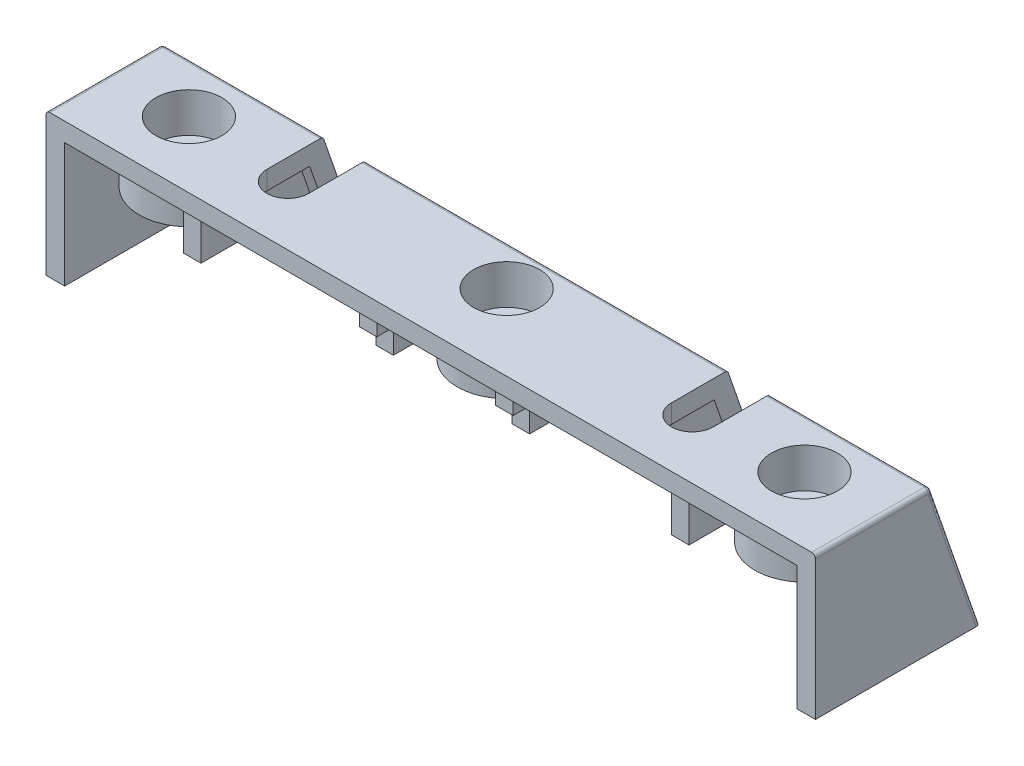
ISO-10303-21;
HEADER;
FILE_DESCRIPTION(('STEP AP214'),'2;1');
FILE_NAME('part.step','',(''),(''),'','','');
FILE_SCHEMA(('AUTOMOTIVE_DESIGN { 1 0 10303 214 1 1 1 1 }'));
ENDSEC;
DATA;
#1=APPLICATION_CONTEXT('core data for automotive mechanical design processes');
#2=APPLICATION_PROTOCOL_DEFINITION('international standard','automotive_design',2000,#1);
#3=PRODUCT_CONTEXT('',#1,'mechanical');
#4=PRODUCT('Part','Part','',(#3));
#5=PRODUCT_RELATED_PRODUCT_CATEGORY('part','',(#4));
#6=PRODUCT_DEFINITION_FORMATION('','',#4);
#7=PRODUCT_DEFINITION_CONTEXT('part definition',#1,'design');
#8=PRODUCT_DEFINITION('design','',#6,#7);
#9=PRODUCT_DEFINITION_SHAPE('','',#8);
#10=(LENGTH_UNIT() NAMED_UNIT(*) SI_UNIT(.MILLI.,.METRE.));
#11=(NAMED_UNIT(*) PLANE_ANGLE_UNIT() SI_UNIT($,.RADIAN.));
#12=(NAMED_UNIT(*) SI_UNIT($,.STERADIAN.) SOLID_ANGLE_UNIT());
#13=UNCERTAINTY_MEASURE_WITH_UNIT(LENGTH_MEASURE(1.E-05),#10,'distance_accuracy_value','');
#14=(GEOMETRIC_REPRESENTATION_CONTEXT(3) GLOBAL_UNCERTAINTY_ASSIGNED_CONTEXT((#13)) GLOBAL_UNIT_ASSIGNED_CONTEXT((#10,
#11,#12)) REPRESENTATION_CONTEXT('',''));
#15=CARTESIAN_POINT('',(0.,0.,0.));
#16=DIRECTION('',(0.,0.,1.));
#17=DIRECTION('',(1.,0.,0.));
#18=AXIS2_PLACEMENT_3D('',#15,#16,#17);
#19=CARTESIAN_POINT('',(35.,12.4439120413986,-8.89352367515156));
#20=DIRECTION('',(0.,-0.327110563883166,0.944986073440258));
#21=DIRECTION('',(0.,-0.944986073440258,-0.327110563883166));
#22=AXIS2_PLACEMENT_3D('',#19,#20,#21);
#23=PLANE('',#22);
#24=DIRECTION('',(-1.,0.,0.));
#25=VECTOR('',#24,1.);
#26=CARTESIAN_POINT('',(35.,11.3,-9.28949322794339));
#27=LINE('',#26,#25);
#28=CARTESIAN_POINT('',(-6.99999999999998,11.3,-9.28949322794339));
#29=VERTEX_POINT('',#28);
#30=CARTESIAN_POINT('',(-16.5,11.3,-9.28949322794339));
#31=VERTEX_POINT('',#30);
#32=EDGE_CURVE('E399',#29,#31,#27,.T.);
#33=ORIENTED_EDGE('',*,*,#32,.T.);
#34=DIRECTION('',(0.,-0.944986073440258,-0.327110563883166));
#35=VECTOR('',#34,1.);
#36=CARTESIAN_POINT('',(-16.5,12.4439120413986,-8.89352367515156));
#37=LINE('',#36,#35);
#38=CARTESIAN_POINT('',(-16.5,8.7,-10.1894932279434));
#39=VERTEX_POINT('',#38);
#40=EDGE_CURVE('E634',#31,#39,#37,.T.);
#41=ORIENTED_EDGE('',*,*,#40,.T.);
#42=CARTESIAN_POINT('',(-18.4,8.7,-10.1894932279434));
#43=DIRECTION('',(0.,-0.327110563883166,0.944986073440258));
#44=DIRECTION('',(0.,0.944986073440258,0.327110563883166));
#45=AXIS2_PLACEMENT_3D('',#42,#43,#44);
#46=ELLIPSE('',#45,2.01061164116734,1.9);
#47=CARTESIAN_POINT('',(-18.4,6.8,-10.8471855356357));
#48=VERTEX_POINT('',#47);
#49=EDGE_CURVE('E512',#39,#48,#46,.F.);
#50=ORIENTED_EDGE('',*,*,#49,.T.);
#51=CARTESIAN_POINT('',(-18.4,8.7,-10.1894932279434));
#52=DIRECTION('',(0.,-0.327110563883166,0.944986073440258));
#53=DIRECTION('',(0.,-0.944986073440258,-0.327110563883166));
#54=AXIS2_PLACEMENT_3D('',#51,#52,#53);
#55=ELLIPSE('',#54,2.01061164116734,1.9);
#56=CARTESIAN_POINT('',(-20.3,8.7,-10.1894932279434));
#57=VERTEX_POINT('',#56);
#58=EDGE_CURVE('E392',#48,#57,#55,.F.);
#59=ORIENTED_EDGE('',*,*,#58,.T.);
#60=DIRECTION('',(0.,-0.944986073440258,-0.327110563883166));
#61=VECTOR('',#60,1.);
#62=CARTESIAN_POINT('',(-20.3,12.4439120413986,-8.89352367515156));
#63=LINE('',#62,#61);
#64=CARTESIAN_POINT('',(-20.3,11.3,-9.28949322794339));
#65=VERTEX_POINT('',#64);
#66=EDGE_CURVE('E379',#65,#57,#63,.T.);
#67=ORIENTED_EDGE('',*,*,#66,.F.);
#68=CARTESIAN_POINT('',(-21.4,11.3,-9.28949322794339));
#69=VERTEX_POINT('',#68);
#70=EDGE_CURVE('E389',#65,#69,#27,.T.);
#71=ORIENTED_EDGE('',*,*,#70,.T.);
#72=DIRECTION('',(0.,-0.944986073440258,-0.327110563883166));
#73=VECTOR('',#72,1.);
#74=CARTESIAN_POINT('',(-21.4,9.78508503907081,-9.81388686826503));
#75=LINE('',#74,#73);
#76=CARTESIAN_POINT('',(-21.4,7.5,-10.604877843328));
#77=VERTEX_POINT('',#76);
#78=EDGE_CURVE('E777',#69,#77,#75,.T.);
#79=ORIENTED_EDGE('',*,*,#78,.T.);
#80=DIRECTION('',(-1.,0.,0.));
#81=VECTOR('',#80,1.);
#82=CARTESIAN_POINT('',(-23.,7.5,-10.604877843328));
#83=LINE('',#82,#81);
#84=CARTESIAN_POINT('',(-23.,7.5,-10.604877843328));
#85=VERTEX_POINT('',#84);
#86=EDGE_CURVE('E782',#77,#85,#83,.T.);
#87=ORIENTED_EDGE('',*,*,#86,.T.);
#88=DIRECTION('',(0.,0.944986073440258,0.327110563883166));
#89=VECTOR('',#88,1.);
#90=CARTESIAN_POINT('',(-23.,9.78508503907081,-9.81388686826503));
#91=LINE('',#90,#89);
#92=CARTESIAN_POINT('',(-23.,11.3,-9.28949322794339));
#93=VERTEX_POINT('',#92);
#94=EDGE_CURVE('E779',#85,#93,#91,.T.);
#95=ORIENTED_EDGE('',*,*,#94,.T.);
#96=CARTESIAN_POINT('',(-24.9292941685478,11.3,-9.28949322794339));
#97=VERTEX_POINT('',#96);
#98=EDGE_CURVE('E400',#93,#97,#27,.T.);
#99=ORIENTED_EDGE('',*,*,#98,.T.);
#100=CARTESIAN_POINT('',(-28.,20.8029804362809,-6.));
#101=DIRECTION('',(0.,-0.327110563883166,0.944986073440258));
#102=DIRECTION('',(0.,0.944986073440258,0.327110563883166));
#103=AXIS2_PLACEMENT_3D('',#100,#101,#102);
#104=ELLIPSE('',#103,13.7568164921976,4.5);
#105=CARTESIAN_POINT('',(-31.0707058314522,11.3,-9.28949322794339));
#106=VERTEX_POINT('',#105);
#107=EDGE_CURVE('E824',#97,#106,#104,.F.);
#108=ORIENTED_EDGE('',*,*,#107,.T.);
#109=CARTESIAN_POINT('',(-33.3,11.3,-9.28949322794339));
#110=VERTEX_POINT('',#109);
#111=EDGE_CURVE('E406',#106,#110,#27,.T.);
#112=ORIENTED_EDGE('',*,*,#111,.T.);
#113=DIRECTION('',(0.,0.944986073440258,0.327110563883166));
#114=VECTOR('',#113,1.);
#115=CARTESIAN_POINT('',(-33.3,15.6896187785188,-7.77000980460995));
#116=LINE('',#115,#114);
#117=CARTESIAN_POINT('',(-33.3,0.,-13.2010316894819));
#118=VERTEX_POINT('',#117);
#119=EDGE_CURVE('E444',#118,#110,#116,.T.);
#120=ORIENTED_EDGE('',*,*,#119,.F.);
#121=DIRECTION('',(-1.,0.,0.));
#122=VECTOR('',#121,1.);
#123=CARTESIAN_POINT('',(35.,0.,-13.2010316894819));
#124=LINE('',#123,#122);
#125=CARTESIAN_POINT('',(33.3,0.,-13.2010316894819));
#126=VERTEX_POINT('',#125);
#127=EDGE_CURVE('E412',#126,#118,#124,.T.);
#128=ORIENTED_EDGE('',*,*,#127,.F.);
#129=DIRECTION('',(0.,0.944986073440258,0.327110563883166));
#130=VECTOR('',#129,1.);
#131=CARTESIAN_POINT('',(33.3,15.6896187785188,-7.77000980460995));
#132=LINE('',#131,#130);
#133=CARTESIAN_POINT('',(33.3,11.3,-9.28949322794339));
#134=VERTEX_POINT('',#133);
#135=EDGE_CURVE('E433',#126,#134,#132,.T.);
#136=ORIENTED_EDGE('',*,*,#135,.T.);
#137=CARTESIAN_POINT('',(31.0707058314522,11.3,-9.28949322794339));
#138=VERTEX_POINT('',#137);
#139=EDGE_CURVE('E403',#134,#138,#27,.T.);
#140=ORIENTED_EDGE('',*,*,#139,.T.);
#141=CARTESIAN_POINT('',(28.,20.8029804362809,-5.99999999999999));
#142=DIRECTION('',(0.,-0.327110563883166,0.944986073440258));
#143=DIRECTION('',(0.,0.944986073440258,0.327110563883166));
#144=AXIS2_PLACEMENT_3D('',#141,#142,#143);
#145=ELLIPSE('',#144,13.7568164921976,4.5);
#146=CARTESIAN_POINT('',(24.9292941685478,11.3,-9.28949322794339));
#147=VERTEX_POINT('',#146);
#148=EDGE_CURVE('E817',#138,#147,#145,.F.);
#149=ORIENTED_EDGE('',*,*,#148,.T.);
#150=CARTESIAN_POINT('',(23.,11.3,-9.28949322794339));
#151=VERTEX_POINT('',#150);
#152=EDGE_CURVE('E407',#147,#151,#27,.T.);
#153=ORIENTED_EDGE('',*,*,#152,.T.);
#154=DIRECTION('',(0.,-0.944986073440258,-0.327110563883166));
#155=VECTOR('',#154,1.);
#156=CARTESIAN_POINT('',(23.,9.78508503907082,-9.81388686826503));
#157=LINE('',#156,#155);
#158=CARTESIAN_POINT('',(23.,7.50000000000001,-10.604877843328));
#159=VERTEX_POINT('',#158);
#160=EDGE_CURVE('E723',#151,#159,#157,.T.);
#161=ORIENTED_EDGE('',*,*,#160,.T.);
#162=DIRECTION('',(-1.,0.,0.));
#163=VECTOR('',#162,1.);
#164=CARTESIAN_POINT('',(21.4,7.50000000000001,-10.604877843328));
#165=LINE('',#164,#163);
#166=CARTESIAN_POINT('',(21.4,7.50000000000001,-10.604877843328));
#167=VERTEX_POINT('',#166);
#168=EDGE_CURVE('E728',#159,#167,#165,.T.);
#169=ORIENTED_EDGE('',*,*,#168,.T.);
#170=DIRECTION('',(0.,0.944986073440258,0.327110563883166));
#171=VECTOR('',#170,1.);
#172=CARTESIAN_POINT('',(21.4,9.78508503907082,-9.81388686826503));
#173=LINE('',#172,#171);
#174=CARTESIAN_POINT('',(21.4,11.3,-9.28949322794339));
#175=VERTEX_POINT('',#174);
#176=EDGE_CURVE('E725',#167,#175,#173,.T.);
#177=ORIENTED_EDGE('',*,*,#176,.T.);
#178=CARTESIAN_POINT('',(20.3,11.3,-9.28949322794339));
#179=VERTEX_POINT('',#178);
#180=EDGE_CURVE('E410',#175,#179,#27,.T.);
#181=ORIENTED_EDGE('',*,*,#180,.T.);
#182=DIRECTION('',(0.,0.944986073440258,0.327110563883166));
#183=VECTOR('',#182,1.);
#184=CARTESIAN_POINT('',(20.3,12.4439120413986,-8.89352367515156));
#185=LINE('',#184,#183);
#186=CARTESIAN_POINT('',(20.3,8.7,-10.1894932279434));
#187=VERTEX_POINT('',#186);
#188=EDGE_CURVE('E650',#187,#179,#185,.T.);
#189=ORIENTED_EDGE('',*,*,#188,.F.);
#190=CARTESIAN_POINT('',(18.4,8.7,-10.1894932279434));
#191=DIRECTION('',(0.,-0.327110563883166,0.944986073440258));
#192=DIRECTION('',(0.,0.944986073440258,0.327110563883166));
#193=AXIS2_PLACEMENT_3D('',#190,#191,#192);
#194=ELLIPSE('',#193,2.01061164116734,1.9);
#195=CARTESIAN_POINT('',(18.4,6.8,-10.8471855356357));
#196=VERTEX_POINT('',#195);
#197=EDGE_CURVE('E533',#187,#196,#194,.F.);
#198=ORIENTED_EDGE('',*,*,#197,.T.);
#199=CARTESIAN_POINT('',(18.4,8.7,-10.1894932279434));
#200=DIRECTION('',(0.,-0.327110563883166,0.944986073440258));
#201=DIRECTION('',(0.,-0.944986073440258,-0.327110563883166));
#202=AXIS2_PLACEMENT_3D('',#199,#200,#201);
#203=ELLIPSE('',#202,2.01061164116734,1.9);
#204=CARTESIAN_POINT('',(16.5,8.7,-10.1894932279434));
#205=VERTEX_POINT('',#204);
#206=EDGE_CURVE('E525',#196,#205,#203,.F.);
#207=ORIENTED_EDGE('',*,*,#206,.T.);
#208=DIRECTION('',(0.,0.944986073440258,0.327110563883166));
#209=VECTOR('',#208,1.);
#210=CARTESIAN_POINT('',(16.5,12.4439120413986,-8.89352367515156));
#211=LINE('',#210,#209);
#212=CARTESIAN_POINT('',(16.5,11.3,-9.28949322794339));
#213=VERTEX_POINT('',#212);
#214=EDGE_CURVE('E655',#205,#213,#211,.T.);
#215=ORIENTED_EDGE('',*,*,#214,.T.);
#216=CARTESIAN_POINT('',(7.,11.3,-9.28949322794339));
#217=VERTEX_POINT('',#216);
#218=EDGE_CURVE('E402',#213,#217,#27,.T.);
#219=ORIENTED_EDGE('',*,*,#218,.T.);
#220=DIRECTION('',(0.,-0.944986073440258,-0.327110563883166));
#221=VECTOR('',#220,1.);
#222=CARTESIAN_POINT('',(7.,9.78508503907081,-9.81388686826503));
#223=LINE('',#222,#221);
#224=CARTESIAN_POINT('',(7.,7.5,-10.604877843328));
#225=VERTEX_POINT('',#224);
#226=EDGE_CURVE('E741',#217,#225,#223,.T.);
#227=ORIENTED_EDGE('',*,*,#226,.T.);
#228=DIRECTION('',(-1.,0.,0.));
#229=VECTOR('',#228,1.);
#230=CARTESIAN_POINT('',(5.4,7.5,-10.604877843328));
#231=LINE('',#230,#229);
#232=CARTESIAN_POINT('',(5.4,7.5,-10.604877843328));
#233=VERTEX_POINT('',#232);
#234=EDGE_CURVE('E746',#225,#233,#231,.T.);
#235=ORIENTED_EDGE('',*,*,#234,.T.);
#236=DIRECTION('',(0.,0.944986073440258,0.327110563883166));
#237=VECTOR('',#236,1.);
#238=CARTESIAN_POINT('',(5.4,9.78508503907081,-9.81388686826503));
#239=LINE('',#238,#237);
#240=CARTESIAN_POINT('',(5.40000000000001,11.3,-9.28949322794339));
#241=VERTEX_POINT('',#240);
#242=EDGE_CURVE('E743',#233,#241,#239,.T.);
#243=ORIENTED_EDGE('',*,*,#242,.T.);
#244=CARTESIAN_POINT('',(3.81942560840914,11.3,-9.28949322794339));
#245=VERTEX_POINT('',#244);
#246=EDGE_CURVE('E405',#241,#245,#27,.T.);
#247=ORIENTED_EDGE('',*,*,#246,.T.);
#248=CARTESIAN_POINT('',(0.,18.174091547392,-6.91));
#249=DIRECTION('',(0.,-0.327110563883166,0.944986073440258));
#250=DIRECTION('',(0.,0.944986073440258,0.327110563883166));
#251=AXIS2_PLACEMENT_3D('',#248,#249,#250);
#252=ELLIPSE('',#251,13.7568164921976,4.5);
#253=CARTESIAN_POINT('',(2.56863343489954,7.5,-10.604877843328));
#254=VERTEX_POINT('',#253);
#255=EDGE_CURVE('E442',#245,#254,#252,.F.);
#256=ORIENTED_EDGE('',*,*,#255,.T.);
#257=DIRECTION('',(1.,0.,0.));
#258=VECTOR('',#257,1.);
#259=CARTESIAN_POINT('',(35.,7.5,-10.604877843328));
#260=LINE('',#259,#258);
#261=CARTESIAN_POINT('',(-2.56863343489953,7.5,-10.604877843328));
#262=VERTEX_POINT('',#261);
#263=EDGE_CURVE('E466',#262,#254,#260,.T.);
#264=ORIENTED_EDGE('',*,*,#263,.F.);
#265=CARTESIAN_POINT('',(-3.81942560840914,11.3,-9.28949322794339));
#266=VERTEX_POINT('',#265);
#267=EDGE_CURVE('E830',#262,#266,#252,.F.);
#268=ORIENTED_EDGE('',*,*,#267,.T.);
#269=CARTESIAN_POINT('',(-5.39999999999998,11.3,-9.28949322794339));
#270=VERTEX_POINT('',#269);
#271=EDGE_CURVE('E404',#266,#270,#27,.T.);
#272=ORIENTED_EDGE('',*,*,#271,.T.);
#273=DIRECTION('',(0.,-0.944986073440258,-0.327110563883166));
#274=VECTOR('',#273,1.);
#275=CARTESIAN_POINT('',(-5.4,9.78508503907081,-9.81388686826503));
#276=LINE('',#275,#274);
#277=CARTESIAN_POINT('',(-5.4,7.5,-10.604877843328));
#278=VERTEX_POINT('',#277);
#279=EDGE_CURVE('E759',#270,#278,#276,.T.);
#280=ORIENTED_EDGE('',*,*,#279,.T.);
#281=DIRECTION('',(-1.,0.,0.));
#282=VECTOR('',#281,1.);
#283=CARTESIAN_POINT('',(-7.,7.5,-10.604877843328));
#284=LINE('',#283,#282);
#285=CARTESIAN_POINT('',(-6.99999999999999,7.5,-10.604877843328));
#286=VERTEX_POINT('',#285);
#287=EDGE_CURVE('E764',#278,#286,#284,.T.);
#288=ORIENTED_EDGE('',*,*,#287,.T.);
#289=DIRECTION('',(0.,0.944986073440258,0.327110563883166));
#290=VECTOR('',#289,1.);
#291=CARTESIAN_POINT('',(-7.,9.78508503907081,-9.81388686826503));
#292=LINE('',#291,#290);
#293=EDGE_CURVE('E761',#286,#29,#292,.T.);
#294=ORIENTED_EDGE('',*,*,#293,.T.);
#295=EDGE_LOOP('',(#33,#41,#50,#59,#67,#71,#79,#87,#95,#99,#108,#112,#120,#128,#136,#140,#149,
#153,#161,#169,#177,#181,#189,#198,#207,#215,#219,#227,#235,#243,#247,#256,#264,#268,#272,#280,
#288,#294));
#296=FACE_BOUND('',#295,.T.);
#297=ADVANCED_FACE('F33',(#296),#23,.T.);
#298=CARTESIAN_POINT('',(35.,11.3,0.));
#299=DIRECTION('',(0.,-1.,0.));
#300=DIRECTION('',(0.,0.,-1.));
#301=AXIS2_PLACEMENT_3D('',#298,#299,#300);
#302=PLANE('',#301);
#303=CARTESIAN_POINT('',(-18.4,11.3,-5.4));
#304=DIRECTION('',(0.,-1.,0.));
#305=DIRECTION('',(0.,0.,-1.));
#306=AXIS2_PLACEMENT_3D('',#303,#304,#305);
#307=CIRCLE('',#306,1.9);
#308=CARTESIAN_POINT('',(-20.3,11.3,-5.4));
#309=VERTEX_POINT('',#308);
#310=CARTESIAN_POINT('',(-18.4,11.3,-3.5));
#311=VERTEX_POINT('',#310);
#312=EDGE_CURVE('E505',#309,#311,#307,.F.);
#313=ORIENTED_EDGE('',*,*,#312,.T.);
#314=CARTESIAN_POINT('',(-18.4,11.3,-5.4));
#315=DIRECTION('',(0.,-1.,0.));
#316=DIRECTION('',(0.,0.,-1.));
#317=AXIS2_PLACEMENT_3D('',#314,#315,#316);
#318=CIRCLE('',#317,1.9);
#319=CARTESIAN_POINT('',(-16.5,11.3,-5.4));
#320=VERTEX_POINT('',#319);
#321=EDGE_CURVE('E514',#311,#320,#318,.F.);
#322=ORIENTED_EDGE('',*,*,#321,.T.);
#323=DIRECTION('',(0.,0.,-1.));
#324=VECTOR('',#323,1.);
#325=CARTESIAN_POINT('',(-16.5,11.3,0.));
#326=LINE('',#325,#324);
#327=EDGE_CURVE('E393',#320,#31,#326,.T.);
#328=ORIENTED_EDGE('',*,*,#327,.T.);
#329=ORIENTED_EDGE('',*,*,#32,.F.);
#330=DIRECTION('',(0.,0.,1.));
#331=VECTOR('',#330,1.);
#332=CARTESIAN_POINT('',(-7.,11.3,-14.1903078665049));
#333=LINE('',#332,#331);
#334=CARTESIAN_POINT('',(-7.,11.3,-0.5));
#335=VERTEX_POINT('',#334);
#336=EDGE_CURVE('E762',#29,#335,#333,.T.);
#337=ORIENTED_EDGE('',*,*,#336,.T.);
#338=DIRECTION('',(-1.,0.,0.));
#339=VECTOR('',#338,1.);
#340=CARTESIAN_POINT('',(-5.4,11.3,-0.5));
#341=LINE('',#340,#339);
#342=CARTESIAN_POINT('',(-5.4,11.3,-0.5));
#343=VERTEX_POINT('',#342);
#344=EDGE_CURVE('E706',#343,#335,#341,.T.);
#345=ORIENTED_EDGE('',*,*,#344,.F.);
#346=DIRECTION('',(0.,0.,1.));
#347=VECTOR('',#346,1.);
#348=CARTESIAN_POINT('',(-5.4,11.3,-14.1903078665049));
#349=LINE('',#348,#347);
#350=EDGE_CURVE('E767',#270,#343,#349,.T.);
#351=ORIENTED_EDGE('',*,*,#350,.F.);
#352=ORIENTED_EDGE('',*,*,#271,.F.);
#353=CARTESIAN_POINT('',(0.,11.3,-6.91));
#354=DIRECTION('',(0.,-1.,0.));
#355=DIRECTION('',(0.,0.,-1.));
#356=AXIS2_PLACEMENT_3D('',#353,#354,#355);
#357=CIRCLE('',#356,4.5);
#358=EDGE_CURVE('E463',#266,#245,#357,.F.);
#359=ORIENTED_EDGE('',*,*,#358,.T.);
#360=ORIENTED_EDGE('',*,*,#246,.F.);
#361=DIRECTION('',(0.,0.,1.));
#362=VECTOR('',#361,1.);
#363=CARTESIAN_POINT('',(5.4,11.3,-14.1903078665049));
#364=LINE('',#363,#362);
#365=CARTESIAN_POINT('',(5.4,11.3,-0.5));
#366=VERTEX_POINT('',#365);
#367=EDGE_CURVE('E744',#241,#366,#364,.T.);
#368=ORIENTED_EDGE('',*,*,#367,.T.);
#369=DIRECTION('',(-1.,0.,0.));
#370=VECTOR('',#369,1.);
#371=CARTESIAN_POINT('',(7.,11.3,-0.5));
#372=LINE('',#371,#370);
#373=CARTESIAN_POINT('',(7.,11.3,-0.5));
#374=VERTEX_POINT('',#373);
#375=EDGE_CURVE('E701',#374,#366,#372,.T.);
#376=ORIENTED_EDGE('',*,*,#375,.F.);
#377=DIRECTION('',(0.,0.,1.));
#378=VECTOR('',#377,1.);
#379=CARTESIAN_POINT('',(7.,11.3,-14.1903078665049));
#380=LINE('',#379,#378);
#381=EDGE_CURVE('E749',#217,#374,#380,.T.);
#382=ORIENTED_EDGE('',*,*,#381,.F.);
#383=ORIENTED_EDGE('',*,*,#218,.F.);
#384=DIRECTION('',(0.,0.,1.));
#385=VECTOR('',#384,1.);
#386=CARTESIAN_POINT('',(16.5,11.3,0.));
#387=LINE('',#386,#385);
#388=CARTESIAN_POINT('',(16.5,11.3,-5.4));
#389=VERTEX_POINT('',#388);
#390=EDGE_CURVE('E652',#213,#389,#387,.T.);
#391=ORIENTED_EDGE('',*,*,#390,.T.);
#392=CARTESIAN_POINT('',(18.4,11.3,-5.4));
#393=DIRECTION('',(0.,-1.,0.));
#394=DIRECTION('',(0.,0.,-1.));
#395=AXIS2_PLACEMENT_3D('',#392,#393,#394);
#396=CIRCLE('',#395,1.9);
#397=CARTESIAN_POINT('',(18.4,11.3,-3.5));
#398=VERTEX_POINT('',#397);
#399=EDGE_CURVE('E518',#389,#398,#396,.F.);
#400=ORIENTED_EDGE('',*,*,#399,.T.);
#401=CARTESIAN_POINT('',(18.4,11.3,-5.4));
#402=DIRECTION('',(0.,-1.,0.));
#403=DIRECTION('',(0.,0.,-1.));
#404=AXIS2_PLACEMENT_3D('',#401,#402,#403);
#405=CIRCLE('',#404,1.9);
#406=CARTESIAN_POINT('',(20.3,11.3,-5.4));
#407=VERTEX_POINT('',#406);
#408=EDGE_CURVE('E527',#398,#407,#405,.F.);
#409=ORIENTED_EDGE('',*,*,#408,.T.);
#410=DIRECTION('',(0.,0.,1.));
#411=VECTOR('',#410,1.);
#412=CARTESIAN_POINT('',(20.3,11.3,0.));
#413=LINE('',#412,#411);
#414=EDGE_CURVE('E644',#179,#407,#413,.T.);
#415=ORIENTED_EDGE('',*,*,#414,.F.);
#416=ORIENTED_EDGE('',*,*,#180,.F.);
#417=DIRECTION('',(0.,0.,1.));
#418=VECTOR('',#417,1.);
#419=CARTESIAN_POINT('',(21.4,11.3,-14.1903078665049));
#420=LINE('',#419,#418);
#421=CARTESIAN_POINT('',(21.4,11.3,-0.5));
#422=VERTEX_POINT('',#421);
#423=EDGE_CURVE('E726',#175,#422,#420,.T.);
#424=ORIENTED_EDGE('',*,*,#423,.T.);
#425=DIRECTION('',(-1.,0.,0.));
#426=VECTOR('',#425,1.);
#427=CARTESIAN_POINT('',(23.,11.3,-0.5));
#428=LINE('',#427,#426);
#429=CARTESIAN_POINT('',(23.,11.3,-0.5));
#430=VERTEX_POINT('',#429);
#431=EDGE_CURVE('E695',#430,#422,#428,.T.);
#432=ORIENTED_EDGE('',*,*,#431,.F.);
#433=DIRECTION('',(0.,0.,1.));
#434=VECTOR('',#433,1.);
#435=CARTESIAN_POINT('',(23.,11.3,-14.1903078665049));
#436=LINE('',#435,#434);
#437=EDGE_CURVE('E731',#151,#430,#436,.T.);
#438=ORIENTED_EDGE('',*,*,#437,.F.);
#439=ORIENTED_EDGE('',*,*,#152,.F.);
#440=CARTESIAN_POINT('',(28.,11.3,-5.99999999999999));
#441=DIRECTION('',(0.,-1.,0.));
#442=DIRECTION('',(0.,0.,-1.));
#443=AXIS2_PLACEMENT_3D('',#440,#441,#442);
#444=CIRCLE('',#443,4.5);
#445=EDGE_CURVE('E813',#138,#147,#444,.T.);
#446=ORIENTED_EDGE('',*,*,#445,.F.);
#447=ORIENTED_EDGE('',*,*,#139,.F.);
#448=DIRECTION('',(0.,0.,1.));
#449=VECTOR('',#448,1.);
#450=CARTESIAN_POINT('',(33.3,11.3,0.));
#451=LINE('',#450,#449);
#452=CARTESIAN_POINT('',(33.3,11.3,0.));
#453=VERTEX_POINT('',#452);
#454=EDGE_CURVE('E428',#134,#453,#451,.T.);
#455=ORIENTED_EDGE('',*,*,#454,.T.);
#456=DIRECTION('',(-1.,0.,0.));
#457=VECTOR('',#456,1.);
#458=CARTESIAN_POINT('',(35.,11.3,0.));
#459=LINE('',#458,#457);
#460=CARTESIAN_POINT('',(-33.3,11.3,0.));
#461=VERTEX_POINT('',#460);
#462=EDGE_CURVE('E423',#453,#461,#459,.T.);
#463=ORIENTED_EDGE('',*,*,#462,.T.);
#464=DIRECTION('',(0.,0.,1.));
#465=VECTOR('',#464,1.);
#466=CARTESIAN_POINT('',(-33.3,11.3,0.));
#467=LINE('',#466,#465);
#468=EDGE_CURVE('E831',#110,#461,#467,.T.);
#469=ORIENTED_EDGE('',*,*,#468,.F.);
#470=ORIENTED_EDGE('',*,*,#111,.F.);
#471=CARTESIAN_POINT('',(-28.,11.3,-6.));
#472=DIRECTION('',(0.,-1.,0.));
#473=DIRECTION('',(0.,0.,-1.));
#474=AXIS2_PLACEMENT_3D('',#471,#472,#473);
#475=CIRCLE('',#474,4.5);
#476=EDGE_CURVE('E820',#97,#106,#475,.T.);
#477=ORIENTED_EDGE('',*,*,#476,.F.);
#478=ORIENTED_EDGE('',*,*,#98,.F.);
#479=DIRECTION('',(0.,0.,1.));
#480=VECTOR('',#479,1.);
#481=CARTESIAN_POINT('',(-23.,11.3,-14.1903078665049));
#482=LINE('',#481,#480);
#483=CARTESIAN_POINT('',(-23.,11.3,-0.5));
#484=VERTEX_POINT('',#483);
#485=EDGE_CURVE('E780',#93,#484,#482,.T.);
#486=ORIENTED_EDGE('',*,*,#485,.T.);
#487=DIRECTION('',(-1.,0.,0.));
#488=VECTOR('',#487,1.);
#489=CARTESIAN_POINT('',(-21.4,11.3,-0.5));
#490=LINE('',#489,#488);
#491=CARTESIAN_POINT('',(-21.4,11.3,-0.5));
#492=VERTEX_POINT('',#491);
#493=EDGE_CURVE('E718',#492,#484,#490,.T.);
#494=ORIENTED_EDGE('',*,*,#493,.F.);
#495=DIRECTION('',(0.,0.,1.));
#496=VECTOR('',#495,1.);
#497=CARTESIAN_POINT('',(-21.4,11.3,-14.1903078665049));
#498=LINE('',#497,#496);
#499=EDGE_CURVE('E397',#69,#492,#498,.T.);
#500=ORIENTED_EDGE('',*,*,#499,.F.);
#501=ORIENTED_EDGE('',*,*,#70,.F.);
#502=DIRECTION('',(0.,0.,-1.));
#503=VECTOR('',#502,1.);
#504=CARTESIAN_POINT('',(-20.3,11.3,0.));
#505=LINE('',#504,#503);
#506=EDGE_CURVE('E374',#309,#65,#505,.T.);
#507=ORIENTED_EDGE('',*,*,#506,.F.);
#508=EDGE_LOOP('',(#313,#322,#328,#329,#337,#345,#351,#352,#359,#360,#368,#376,#382,#383,#391,
#400,#409,#415,#416,#424,#432,#438,#439,#446,#447,#455,#463,#469,#470,#477,#478,#486,#494,#500,
#501,#507));
#509=FACE_BOUND('',#508,.T.);
#510=ADVANCED_FACE('F395',(#509),#302,.T.);
#511=CARTESIAN_POINT('',(35.,13.,-10.5));
#512=DIRECTION('',(0.,-0.327110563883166,0.944986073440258));
#513=DIRECTION('',(0.,-0.944986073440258,-0.327110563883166));
#514=AXIS2_PLACEMENT_3D('',#511,#512,#513);
#515=PLANE('',#514);
#516=DIRECTION('',(-1.,0.,0.));
#517=VECTOR('',#516,1.);
#518=CARTESIAN_POINT('',(35.,12.7644886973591,-10.5815231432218));
#519=LINE('',#518,#517);
#520=CARTESIAN_POINT('',(20.3,12.7644886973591,-10.5815231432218));
#521=VERTEX_POINT('',#520);
#522=CARTESIAN_POINT('',(34.65,12.7644886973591,-10.5815231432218));
#523=VERTEX_POINT('',#522);
#524=EDGE_CURVE('E576',#521,#523,#519,.F.);
#525=ORIENTED_EDGE('',*,*,#524,.T.);
#526=DIRECTION('',(0.,0.944986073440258,0.327110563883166));
#527=VECTOR('',#526,1.);
#528=CARTESIAN_POINT('',(34.65,13.,-10.5));
#529=LINE('',#528,#527);
#530=CARTESIAN_POINT('',(34.65,0.,-15.));
#531=VERTEX_POINT('',#530);
#532=EDGE_CURVE('E578',#523,#531,#529,.F.);
#533=ORIENTED_EDGE('',*,*,#532,.T.);
#534=DIRECTION('',(-1.,0.,0.));
#535=VECTOR('',#534,1.);
#536=CARTESIAN_POINT('',(35.,0.,-15.));
#537=LINE('',#536,#535);
#538=CARTESIAN_POINT('',(-34.65,0.,-15.));
#539=VERTEX_POINT('',#538);
#540=EDGE_CURVE('E456',#531,#539,#537,.T.);
#541=ORIENTED_EDGE('',*,*,#540,.T.);
#542=DIRECTION('',(0.,0.944986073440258,0.327110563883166));
#543=VECTOR('',#542,1.);
#544=CARTESIAN_POINT('',(-34.65,13.,-10.5));
#545=LINE('',#544,#543);
#546=CARTESIAN_POINT('',(-34.65,12.7644886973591,-10.5815231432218));
#547=VERTEX_POINT('',#546);
#548=EDGE_CURVE('E570',#539,#547,#545,.T.);
#549=ORIENTED_EDGE('',*,*,#548,.T.);
#550=DIRECTION('',(-1.,0.,0.));
#551=VECTOR('',#550,1.);
#552=CARTESIAN_POINT('',(35.,12.7644886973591,-10.5815231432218));
#553=LINE('',#552,#551);
#554=CARTESIAN_POINT('',(-20.3,12.7644886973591,-10.5815231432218));
#555=VERTEX_POINT('',#554);
#556=EDGE_CURVE('E572',#547,#555,#553,.F.);
#557=ORIENTED_EDGE('',*,*,#556,.T.);
#558=DIRECTION('',(0.,0.944986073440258,0.327110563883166));
#559=VECTOR('',#558,1.);
#560=CARTESIAN_POINT('',(-20.3,6.8,-12.6461538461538));
#561=LINE('',#560,#559);
#562=CARTESIAN_POINT('',(-20.3,8.7,-11.9884615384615));
#563=VERTEX_POINT('',#562);
#564=EDGE_CURVE('E539',#563,#555,#561,.T.);
#565=ORIENTED_EDGE('',*,*,#564,.F.);
#566=CARTESIAN_POINT('',(-18.4,8.7,-11.9884615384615));
#567=DIRECTION('',(0.,-0.327110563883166,0.944986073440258));
#568=DIRECTION('',(0.,-0.944986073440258,-0.327110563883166));
#569=AXIS2_PLACEMENT_3D('',#566,#567,#568);
#570=ELLIPSE('',#569,2.01061164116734,1.9);
#571=CARTESIAN_POINT('',(-18.4,6.8,-12.6461538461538));
#572=VERTEX_POINT('',#571);
#573=EDGE_CURVE('E502',#563,#572,#570,.T.);
#574=ORIENTED_EDGE('',*,*,#573,.T.);
#575=CARTESIAN_POINT('',(-18.4,8.7,-11.9884615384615));
#576=DIRECTION('',(0.,-0.327110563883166,0.944986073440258));
#577=DIRECTION('',(0.,0.944986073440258,0.327110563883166));
#578=AXIS2_PLACEMENT_3D('',#575,#576,#577);
#579=ELLIPSE('',#578,2.01061164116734,1.9);
#580=CARTESIAN_POINT('',(-16.5,8.7,-11.9884615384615));
#581=VERTEX_POINT('',#580);
#582=EDGE_CURVE('E510',#572,#581,#579,.T.);
#583=ORIENTED_EDGE('',*,*,#582,.T.);
#584=DIRECTION('',(0.,0.944986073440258,0.327110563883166));
#585=VECTOR('',#584,1.);
#586=CARTESIAN_POINT('',(-16.5,6.8,-12.6461538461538));
#587=LINE('',#586,#585);
#588=CARTESIAN_POINT('',(-16.5,12.7644886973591,-10.5815231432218));
#589=VERTEX_POINT('',#588);
#590=EDGE_CURVE('E628',#581,#589,#587,.T.);
#591=ORIENTED_EDGE('',*,*,#590,.T.);
#592=DIRECTION('',(-1.,0.,0.));
#593=VECTOR('',#592,1.);
#594=CARTESIAN_POINT('',(35.,12.7644886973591,-10.5815231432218));
#595=LINE('',#594,#593);
#596=CARTESIAN_POINT('',(16.5,12.7644886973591,-10.5815231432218));
#597=VERTEX_POINT('',#596);
#598=EDGE_CURVE('E574',#589,#597,#595,.F.);
#599=ORIENTED_EDGE('',*,*,#598,.T.);
#600=DIRECTION('',(0.,0.944986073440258,0.327110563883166));
#601=VECTOR('',#600,1.);
#602=CARTESIAN_POINT('',(16.5,6.8,-12.6461538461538));
#603=LINE('',#602,#601);
#604=CARTESIAN_POINT('',(16.5,8.7,-11.9884615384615));
#605=VERTEX_POINT('',#604);
#606=EDGE_CURVE('E638',#605,#597,#603,.T.);
#607=ORIENTED_EDGE('',*,*,#606,.F.);
#608=CARTESIAN_POINT('',(18.4,8.7,-11.9884615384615));
#609=DIRECTION('',(0.,-0.327110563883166,0.944986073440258));
#610=DIRECTION('',(0.,-0.944986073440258,-0.327110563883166));
#611=AXIS2_PLACEMENT_3D('',#608,#609,#610);
#612=ELLIPSE('',#611,2.01061164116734,1.9);
#613=CARTESIAN_POINT('',(18.4,6.8,-12.6461538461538));
#614=VERTEX_POINT('',#613);
#615=EDGE_CURVE('E523',#605,#614,#612,.T.);
#616=ORIENTED_EDGE('',*,*,#615,.T.);
#617=CARTESIAN_POINT('',(18.4,8.7,-11.9884615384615));
#618=DIRECTION('',(0.,-0.327110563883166,0.944986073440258));
#619=DIRECTION('',(0.,0.944986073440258,0.327110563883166));
#620=AXIS2_PLACEMENT_3D('',#617,#618,#619);
#621=ELLIPSE('',#620,2.01061164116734,1.9);
#622=CARTESIAN_POINT('',(20.3,8.7,-11.9884615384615));
#623=VERTEX_POINT('',#622);
#624=EDGE_CURVE('E531',#614,#623,#621,.T.);
#625=ORIENTED_EDGE('',*,*,#624,.T.);
#626=DIRECTION('',(0.,0.944986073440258,0.327110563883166));
#627=VECTOR('',#626,1.);
#628=CARTESIAN_POINT('',(20.3,6.8,-12.6461538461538));
#629=LINE('',#628,#627);
#630=EDGE_CURVE('E637',#623,#521,#629,.T.);
#631=ORIENTED_EDGE('',*,*,#630,.T.);
#632=EDGE_LOOP('',(#525,#533,#541,#549,#557,#565,#574,#583,#591,#599,#607,#616,#625,#631));
#633=FACE_BOUND('',#632,.T.);
#634=ADVANCED_FACE('F625',(#633),#515,.F.);
#635=CARTESIAN_POINT('',(35.,13.,0.));
#636=DIRECTION('',(0.,-1.,0.));
#637=DIRECTION('',(0.,0.,-1.));
#638=AXIS2_PLACEMENT_3D('',#635,#636,#637);
#639=PLANE('',#638);
#640=CARTESIAN_POINT('',(28.,13.,-5.99999999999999));
#641=DIRECTION('',(0.,1.,0.));
#642=DIRECTION('',(0.,0.,1.));
#643=AXIS2_PLACEMENT_3D('',#640,#641,#642);
#644=CIRCLE('',#643,3.);
#645=CARTESIAN_POINT('',(28.,13.,-2.99999999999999));
#646=VERTEX_POINT('',#645);
#647=EDGE_CURVE('E792',#646,#646,#644,.T.);
#648=ORIENTED_EDGE('',*,*,#647,.F.);
#649=EDGE_LOOP('',(#648));
#650=FACE_BOUND('',#649,.T.);
#651=CARTESIAN_POINT('',(0.,13.,-6.91));
#652=DIRECTION('',(0.,1.,0.));
#653=DIRECTION('',(0.,0.,1.));
#654=AXIS2_PLACEMENT_3D('',#651,#652,#653);
#655=CIRCLE('',#654,3.);
#656=CARTESIAN_POINT('',(0.,13.,-3.91));
#657=VERTEX_POINT('',#656);
#658=EDGE_CURVE('E481',#657,#657,#655,.T.);
#659=ORIENTED_EDGE('',*,*,#658,.F.);
#660=EDGE_LOOP('',(#659));
#661=FACE_BOUND('',#660,.T.);
#662=CARTESIAN_POINT('',(-28.,13.,-6.));
#663=DIRECTION('',(0.,1.,0.));
#664=DIRECTION('',(0.,0.,1.));
#665=AXIS2_PLACEMENT_3D('',#662,#663,#664);
#666=CIRCLE('',#665,3.);
#667=CARTESIAN_POINT('',(-28.,13.,-3.));
#668=VERTEX_POINT('',#667);
#669=EDGE_CURVE('E476',#668,#668,#666,.T.);
#670=ORIENTED_EDGE('',*,*,#669,.F.);
#671=EDGE_LOOP('',(#670));
#672=FACE_BOUND('',#671,.T.);
#673=DIRECTION('',(-1.,0.,0.));
#674=VECTOR('',#673,1.);
#675=CARTESIAN_POINT('',(35.,13.,0.));
#676=LINE('',#675,#674);
#677=CARTESIAN_POINT('',(34.65,13.,0.));
#678=VERTEX_POINT('',#677);
#679=CARTESIAN_POINT('',(-34.65,13.,0.));
#680=VERTEX_POINT('',#679);
#681=EDGE_CURVE('E451',#678,#680,#676,.T.);
#682=ORIENTED_EDGE('',*,*,#681,.F.);
#683=DIRECTION('',(0.,0.,1.));
#684=VECTOR('',#683,1.);
#685=CARTESIAN_POINT('',(34.65,13.,0.));
#686=LINE('',#685,#684);
#687=CARTESIAN_POINT('',(34.65,13.,-10.2507780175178));
#688=VERTEX_POINT('',#687);
#689=EDGE_CURVE('E568',#678,#688,#686,.F.);
#690=ORIENTED_EDGE('',*,*,#689,.T.);
#691=DIRECTION('',(-1.,0.,0.));
#692=VECTOR('',#691,1.);
#693=CARTESIAN_POINT('',(35.,13.,-10.2507780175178));
#694=LINE('',#693,#692);
#695=CARTESIAN_POINT('',(20.3,13.,-10.2507780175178));
#696=VERTEX_POINT('',#695);
#697=EDGE_CURVE('E566',#688,#696,#694,.T.);
#698=ORIENTED_EDGE('',*,*,#697,.T.);
#699=DIRECTION('',(0.,0.,1.));
#700=VECTOR('',#699,1.);
#701=CARTESIAN_POINT('',(20.3,13.,-10.5));
#702=LINE('',#701,#700);
#703=CARTESIAN_POINT('',(20.3,13.,-5.4));
#704=VERTEX_POINT('',#703);
#705=EDGE_CURVE('E642',#696,#704,#702,.T.);
#706=ORIENTED_EDGE('',*,*,#705,.T.);
#707=CARTESIAN_POINT('',(18.4,13.,-5.4));
#708=DIRECTION('',(0.,-1.,0.));
#709=DIRECTION('',(0.,0.,-1.));
#710=AXIS2_PLACEMENT_3D('',#707,#708,#709);
#711=CIRCLE('',#710,1.9);
#712=CARTESIAN_POINT('',(18.4,13.,-3.5));
#713=VERTEX_POINT('',#712);
#714=EDGE_CURVE('E529',#704,#713,#711,.T.);
#715=ORIENTED_EDGE('',*,*,#714,.T.);
#716=CARTESIAN_POINT('',(18.4,13.,-5.4));
#717=DIRECTION('',(0.,-1.,0.));
#718=DIRECTION('',(0.,0.,-1.));
#719=AXIS2_PLACEMENT_3D('',#716,#717,#718);
#720=CIRCLE('',#719,1.9);
#721=CARTESIAN_POINT('',(16.5,13.,-5.4));
#722=VERTEX_POINT('',#721);
#723=EDGE_CURVE('E520',#713,#722,#720,.T.);
#724=ORIENTED_EDGE('',*,*,#723,.T.);
#725=DIRECTION('',(0.,0.,1.));
#726=VECTOR('',#725,1.);
#727=CARTESIAN_POINT('',(16.5,13.,-10.5));
#728=LINE('',#727,#726);
#729=CARTESIAN_POINT('',(16.5,13.,-10.2507780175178));
#730=VERTEX_POINT('',#729);
#731=EDGE_CURVE('E641',#730,#722,#728,.T.);
#732=ORIENTED_EDGE('',*,*,#731,.F.);
#733=DIRECTION('',(-1.,0.,0.));
#734=VECTOR('',#733,1.);
#735=CARTESIAN_POINT('',(35.,13.,-10.2507780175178));
#736=LINE('',#735,#734);
#737=CARTESIAN_POINT('',(-16.5,13.,-10.2507780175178));
#738=VERTEX_POINT('',#737);
#739=EDGE_CURVE('E563',#730,#738,#736,.T.);
#740=ORIENTED_EDGE('',*,*,#739,.T.);
#741=DIRECTION('',(0.,0.,1.));
#742=VECTOR('',#741,1.);
#743=CARTESIAN_POINT('',(-16.5,13.,-10.5));
#744=LINE('',#743,#742);
#745=CARTESIAN_POINT('',(-16.5,13.,-5.4));
#746=VERTEX_POINT('',#745);
#747=EDGE_CURVE('E385',#738,#746,#744,.T.);
#748=ORIENTED_EDGE('',*,*,#747,.T.);
#749=CARTESIAN_POINT('',(-18.4,13.,-5.4));
#750=DIRECTION('',(0.,-1.,0.));
#751=DIRECTION('',(0.,0.,-1.));
#752=AXIS2_PLACEMENT_3D('',#749,#750,#751);
#753=CIRCLE('',#752,1.9);
#754=CARTESIAN_POINT('',(-18.4,13.,-3.5));
#755=VERTEX_POINT('',#754);
#756=EDGE_CURVE('E516',#746,#755,#753,.T.);
#757=ORIENTED_EDGE('',*,*,#756,.T.);
#758=CARTESIAN_POINT('',(-18.4,13.,-5.4));
#759=DIRECTION('',(0.,-1.,0.));
#760=DIRECTION('',(0.,0.,-1.));
#761=AXIS2_PLACEMENT_3D('',#758,#759,#760);
#762=CIRCLE('',#761,1.9);
#763=CARTESIAN_POINT('',(-20.3,13.,-5.4));
#764=VERTEX_POINT('',#763);
#765=EDGE_CURVE('E507',#755,#764,#762,.T.);
#766=ORIENTED_EDGE('',*,*,#765,.T.);
#767=DIRECTION('',(0.,0.,1.));
#768=VECTOR('',#767,1.);
#769=CARTESIAN_POINT('',(-20.3,13.,-10.5));
#770=LINE('',#769,#768);
#771=CARTESIAN_POINT('',(-20.3,13.,-10.2507780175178));
#772=VERTEX_POINT('',#771);
#773=EDGE_CURVE('E618',#772,#764,#770,.T.);
#774=ORIENTED_EDGE('',*,*,#773,.F.);
#775=DIRECTION('',(-1.,0.,0.));
#776=VECTOR('',#775,1.);
#777=CARTESIAN_POINT('',(35.,13.,-10.2507780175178));
#778=LINE('',#777,#776);
#779=CARTESIAN_POINT('',(-34.65,13.,-10.2507780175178));
#780=VERTEX_POINT('',#779);
#781=EDGE_CURVE('E560',#772,#780,#778,.T.);
#782=ORIENTED_EDGE('',*,*,#781,.T.);
#783=DIRECTION('',(0.,0.,1.));
#784=VECTOR('',#783,1.);
#785=CARTESIAN_POINT('',(-34.65,13.,0.));
#786=LINE('',#785,#784);
#787=EDGE_CURVE('E558',#780,#680,#786,.T.);
#788=ORIENTED_EDGE('',*,*,#787,.T.);
#789=EDGE_LOOP('',(#682,#690,#698,#706,#715,#724,#732,#740,#748,#757,#766,#774,#782,#788));
#790=FACE_BOUND('',#789,.T.);
#791=ADVANCED_FACE('F617',(#650,#661,#672,#790),#639,.F.);
#792=CARTESIAN_POINT('',(-7.,7.5,-14.1903078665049));
#793=DIRECTION('',(0.,-1.,0.));
#794=DIRECTION('',(0.,0.,-1.));
#795=AXIS2_PLACEMENT_3D('',#792,#793,#794);
#796=PLANE('',#795);
#797=DIRECTION('',(0.,0.,1.));
#798=VECTOR('',#797,1.);
#799=CARTESIAN_POINT('',(-5.4,7.5,-14.1903078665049));
#800=LINE('',#799,#798);
#801=CARTESIAN_POINT('',(-5.4,7.5,-2.));
#802=VERTEX_POINT('',#801);
#803=EDGE_CURVE('E770',#278,#802,#800,.T.);
#804=ORIENTED_EDGE('',*,*,#803,.T.);
#805=DIRECTION('',(1.,0.,0.));
#806=VECTOR('',#805,1.);
#807=CARTESIAN_POINT('',(-7.,7.5,-2.));
#808=LINE('',#807,#806);
#809=CARTESIAN_POINT('',(-7.,7.5,-2.));
#810=VERTEX_POINT('',#809);
#811=EDGE_CURVE('E658',#810,#802,#808,.T.);
#812=ORIENTED_EDGE('',*,*,#811,.F.);
#813=DIRECTION('',(0.,0.,1.));
#814=VECTOR('',#813,1.);
#815=CARTESIAN_POINT('',(-7.,7.5,-14.1903078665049));
#816=LINE('',#815,#814);
#817=EDGE_CURVE('E758',#286,#810,#816,.T.);
#818=ORIENTED_EDGE('',*,*,#817,.F.);
#819=ORIENTED_EDGE('',*,*,#287,.F.);
#820=EDGE_LOOP('',(#804,#812,#818,#819));
#821=FACE_BOUND('',#820,.T.);
#822=ADVANCED_FACE('F972',(#821),#796,.T.);
#823=CARTESIAN_POINT('',(5.4,7.5,-14.1903078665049));
#824=DIRECTION('',(0.,-1.,0.));
#825=DIRECTION('',(0.,0.,-1.));
#826=AXIS2_PLACEMENT_3D('',#823,#824,#825);
#827=PLANE('',#826);
#828=DIRECTION('',(0.,0.,1.));
#829=VECTOR('',#828,1.);
#830=CARTESIAN_POINT('',(7.,7.5,-14.1903078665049));
#831=LINE('',#830,#829);
#832=CARTESIAN_POINT('',(7.,7.5,-2.));
#833=VERTEX_POINT('',#832);
#834=EDGE_CURVE('E752',#225,#833,#831,.T.);
#835=ORIENTED_EDGE('',*,*,#834,.T.);
#836=DIRECTION('',(1.,0.,0.));
#837=VECTOR('',#836,1.);
#838=CARTESIAN_POINT('',(5.4,7.5,-2.));
#839=LINE('',#838,#837);
#840=CARTESIAN_POINT('',(5.4,7.5,-2.));
#841=VERTEX_POINT('',#840);
#842=EDGE_CURVE('E677',#841,#833,#839,.T.);
#843=ORIENTED_EDGE('',*,*,#842,.F.);
#844=DIRECTION('',(0.,0.,1.));
#845=VECTOR('',#844,1.);
#846=CARTESIAN_POINT('',(5.4,7.5,-14.1903078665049));
#847=LINE('',#846,#845);
#848=EDGE_CURVE('E740',#233,#841,#847,.T.);
#849=ORIENTED_EDGE('',*,*,#848,.F.);
#850=ORIENTED_EDGE('',*,*,#234,.F.);
#851=EDGE_LOOP('',(#835,#843,#849,#850));
#852=FACE_BOUND('',#851,.T.);
#853=ADVANCED_FACE('F1422',(#852),#827,.T.);
#854=CARTESIAN_POINT('',(21.4,11.3,-14.1903078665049));
#855=DIRECTION('',(-1.,0.,0.));
#856=DIRECTION('',(0.,0.,1.));
#857=AXIS2_PLACEMENT_3D('',#854,#855,#856);
#858=PLANE('',#857);
#859=DIRECTION('',(0.,0.,1.));
#860=VECTOR('',#859,1.);
#861=CARTESIAN_POINT('',(21.4,7.50000000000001,-14.1903078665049));
#862=LINE('',#861,#860);
#863=CARTESIAN_POINT('',(21.4,7.50000000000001,-0.5));
#864=VERTEX_POINT('',#863);
#865=EDGE_CURVE('E722',#167,#864,#862,.T.);
#866=ORIENTED_EDGE('',*,*,#865,.T.);
#867=DIRECTION('',(0.,-1.,0.));
#868=VECTOR('',#867,1.);
#869=CARTESIAN_POINT('',(21.4,11.3,-0.5));
#870=LINE('',#869,#868);
#871=EDGE_CURVE('E697',#422,#864,#870,.T.);
#872=ORIENTED_EDGE('',*,*,#871,.F.);
#873=ORIENTED_EDGE('',*,*,#423,.F.);
#874=ORIENTED_EDGE('',*,*,#176,.F.);
#875=EDGE_LOOP('',(#866,#872,#873,#874));
#876=FACE_BOUND('',#875,.T.);
#877=ADVANCED_FACE('F916',(#876),#858,.T.);
#878=CARTESIAN_POINT('',(23.,11.3,-14.1903078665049));
#879=DIRECTION('',(1.,0.,0.));
#880=DIRECTION('',(0.,0.,-1.));
#881=AXIS2_PLACEMENT_3D('',#878,#879,#880);
#882=PLANE('',#881);
#883=ORIENTED_EDGE('',*,*,#437,.T.);
#884=DIRECTION('',(0.,1.,0.));
#885=VECTOR('',#884,1.);
#886=CARTESIAN_POINT('',(23.,7.50000000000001,-0.5));
#887=LINE('',#886,#885);
#888=CARTESIAN_POINT('',(23.,7.50000000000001,-0.5));
#889=VERTEX_POINT('',#888);
#890=EDGE_CURVE('E692',#889,#430,#887,.T.);
#891=ORIENTED_EDGE('',*,*,#890,.F.);
#892=DIRECTION('',(0.,0.,1.));
#893=VECTOR('',#892,1.);
#894=CARTESIAN_POINT('',(23.,7.50000000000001,-14.1903078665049));
#895=LINE('',#894,#893);
#896=EDGE_CURVE('E734',#159,#889,#895,.T.);
#897=ORIENTED_EDGE('',*,*,#896,.F.);
#898=ORIENTED_EDGE('',*,*,#160,.F.);
#899=EDGE_LOOP('',(#883,#891,#897,#898));
#900=FACE_BOUND('',#899,.T.);
#901=ADVANCED_FACE('F928',(#900),#882,.T.);
#902=CARTESIAN_POINT('',(21.4,7.50000000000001,-14.1903078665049));
#903=DIRECTION('',(0.,-1.,0.));
#904=DIRECTION('',(1.,0.,0.));
#905=AXIS2_PLACEMENT_3D('',#902,#903,#904);
#906=PLANE('',#905);
#907=ORIENTED_EDGE('',*,*,#896,.T.);
#908=DIRECTION('',(1.,0.,0.));
#909=VECTOR('',#908,1.);
#910=CARTESIAN_POINT('',(21.4,7.50000000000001,-0.5));
#911=LINE('',#910,#909);
#912=EDGE_CURVE('E689',#864,#889,#911,.T.);
#913=ORIENTED_EDGE('',*,*,#912,.F.);
#914=ORIENTED_EDGE('',*,*,#865,.F.);
#915=ORIENTED_EDGE('',*,*,#168,.F.);
#916=EDGE_LOOP('',(#907,#913,#914,#915));
#917=FACE_BOUND('',#916,.T.);
#918=ADVANCED_FACE('F923',(#917),#906,.T.);
#919=CARTESIAN_POINT('',(5.4,11.3,-14.1903078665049));
#920=DIRECTION('',(-1.,0.,0.));
#921=DIRECTION('',(0.,-1.,0.));
#922=AXIS2_PLACEMENT_3D('',#919,#920,#921);
#923=PLANE('',#922);
#924=DIRECTION('',(0.,0.,1.));
#925=VECTOR('',#924,1.);
#926=CARTESIAN_POINT('',(5.4,9.7,-2.));
#927=LINE('',#926,#925);
#928=CARTESIAN_POINT('',(5.4,9.7,-2.));
#929=VERTEX_POINT('',#928);
#930=CARTESIAN_POINT('',(5.4,9.7,-0.5));
#931=VERTEX_POINT('',#930);
#932=EDGE_CURVE('E686',#929,#931,#927,.T.);
#933=ORIENTED_EDGE('',*,*,#932,.T.);
#934=DIRECTION('',(0.,-1.,0.));
#935=VECTOR('',#934,1.);
#936=CARTESIAN_POINT('',(5.4,11.3,-0.5));
#937=LINE('',#936,#935);
#938=EDGE_CURVE('E703',#366,#931,#937,.T.);
#939=ORIENTED_EDGE('',*,*,#938,.F.);
#940=ORIENTED_EDGE('',*,*,#367,.F.);
#941=ORIENTED_EDGE('',*,*,#242,.F.);
#942=ORIENTED_EDGE('',*,*,#848,.T.);
#943=DIRECTION('',(0.,-1.,0.));
#944=VECTOR('',#943,1.);
#945=CARTESIAN_POINT('',(5.4,9.7,-2.));
#946=LINE('',#945,#944);
#947=EDGE_CURVE('E675',#929,#841,#946,.T.);
#948=ORIENTED_EDGE('',*,*,#947,.F.);
#949=EDGE_LOOP('',(#933,#939,#940,#941,#942,#948));
#950=FACE_BOUND('',#949,.T.);
#951=ADVANCED_FACE('F1449',(#950),#923,.T.);
#952=CARTESIAN_POINT('',(7.,11.3,-14.1903078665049));
#953=DIRECTION('',(1.,0.,0.));
#954=DIRECTION('',(0.,1.,0.));
#955=AXIS2_PLACEMENT_3D('',#952,#953,#954);
#956=PLANE('',#955);
#957=DIRECTION('',(0.,0.,1.));
#958=VECTOR('',#957,1.);
#959=CARTESIAN_POINT('',(7.,9.7,-2.));
#960=LINE('',#959,#958);
#961=CARTESIAN_POINT('',(7.,9.7,-2.));
#962=VERTEX_POINT('',#961);
#963=CARTESIAN_POINT('',(7.,9.7,-0.5));
#964=VERTEX_POINT('',#963);
#965=EDGE_CURVE('E684',#962,#964,#960,.T.);
#966=ORIENTED_EDGE('',*,*,#965,.F.);
#967=DIRECTION('',(0.,1.,0.));
#968=VECTOR('',#967,1.);
#969=CARTESIAN_POINT('',(7.,7.5,-2.));
#970=LINE('',#969,#968);
#971=EDGE_CURVE('E679',#833,#962,#970,.T.);
#972=ORIENTED_EDGE('',*,*,#971,.F.);
#973=ORIENTED_EDGE('',*,*,#834,.F.);
#974=ORIENTED_EDGE('',*,*,#226,.F.);
#975=ORIENTED_EDGE('',*,*,#381,.T.);
#976=DIRECTION('',(0.,1.,0.));
#977=VECTOR('',#976,1.);
#978=CARTESIAN_POINT('',(7.,7.5,-0.5));
#979=LINE('',#978,#977);
#980=EDGE_CURVE('E699',#964,#374,#979,.T.);
#981=ORIENTED_EDGE('',*,*,#980,.F.);
#982=EDGE_LOOP('',(#966,#972,#973,#974,#975,#981));
#983=FACE_BOUND('',#982,.T.);
#984=ADVANCED_FACE('F1456',(#983),#956,.T.);
#985=CARTESIAN_POINT('',(-7.,11.3,-14.1903078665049));
#986=DIRECTION('',(-1.,0.,0.));
#987=DIRECTION('',(0.,-1.,0.));
#988=AXIS2_PLACEMENT_3D('',#985,#986,#987);
#989=PLANE('',#988);
#990=DIRECTION('',(0.,0.,1.));
#991=VECTOR('',#990,1.);
#992=CARTESIAN_POINT('',(-7.,9.7,-2.));
#993=LINE('',#992,#991);
#994=CARTESIAN_POINT('',(-7.,9.7,-2.));
#995=VERTEX_POINT('',#994);
#996=CARTESIAN_POINT('',(-7.,9.7,-0.5));
#997=VERTEX_POINT('',#996);
#998=EDGE_CURVE('E670',#995,#997,#993,.T.);
#999=ORIENTED_EDGE('',*,*,#998,.T.);
#1000=DIRECTION('',(0.,-1.,0.));
#1001=VECTOR('',#1000,1.);
#1002=CARTESIAN_POINT('',(-7.,11.3,-0.5));
#1003=LINE('',#1002,#1001);
#1004=EDGE_CURVE('E708',#335,#997,#1003,.T.);
#1005=ORIENTED_EDGE('',*,*,#1004,.F.);
#1006=ORIENTED_EDGE('',*,*,#336,.F.);
#1007=ORIENTED_EDGE('',*,*,#293,.F.);
#1008=ORIENTED_EDGE('',*,*,#817,.T.);
#1009=DIRECTION('',(0.,-1.,0.));
#1010=VECTOR('',#1009,1.);
#1011=CARTESIAN_POINT('',(-7.,9.7,-2.));
#1012=LINE('',#1011,#1010);
#1013=EDGE_CURVE('E666',#995,#810,#1012,.T.);
#1014=ORIENTED_EDGE('',*,*,#1013,.F.);
#1015=EDGE_LOOP('',(#999,#1005,#1006,#1007,#1008,#1014));
#1016=FACE_BOUND('',#1015,.T.);
#1017=ADVANCED_FACE('F1464',(#1016),#989,.T.);
#1018=CARTESIAN_POINT('',(-5.4,11.3,-14.1903078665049));
#1019=DIRECTION('',(1.,0.,0.));
#1020=DIRECTION('',(0.,1.,0.));
#1021=AXIS2_PLACEMENT_3D('',#1018,#1019,#1020);
#1022=PLANE('',#1021);
#1023=DIRECTION('',(0.,0.,1.));
#1024=VECTOR('',#1023,1.);
#1025=CARTESIAN_POINT('',(-5.4,9.7,-2.));
#1026=LINE('',#1025,#1024);
#1027=CARTESIAN_POINT('',(-5.4,9.7,-2.));
#1028=VERTEX_POINT('',#1027);
#1029=CARTESIAN_POINT('',(-5.4,9.7,-0.5));
#1030=VERTEX_POINT('',#1029);
#1031=EDGE_CURVE('E668',#1028,#1030,#1026,.T.);
#1032=ORIENTED_EDGE('',*,*,#1031,.F.);
#1033=DIRECTION('',(0.,1.,0.));
#1034=VECTOR('',#1033,1.);
#1035=CARTESIAN_POINT('',(-5.4,7.5,-2.));
#1036=LINE('',#1035,#1034);
#1037=EDGE_CURVE('E660',#802,#1028,#1036,.T.);
#1038=ORIENTED_EDGE('',*,*,#1037,.F.);
#1039=ORIENTED_EDGE('',*,*,#803,.F.);
#1040=ORIENTED_EDGE('',*,*,#279,.F.);
#1041=ORIENTED_EDGE('',*,*,#350,.T.);
#1042=DIRECTION('',(0.,1.,0.));
#1043=VECTOR('',#1042,1.);
#1044=CARTESIAN_POINT('',(-5.4,7.5,-0.5));
#1045=LINE('',#1044,#1043);
#1046=EDGE_CURVE('E711',#1030,#343,#1045,.T.);
#1047=ORIENTED_EDGE('',*,*,#1046,.F.);
#1048=EDGE_LOOP('',(#1032,#1038,#1039,#1040,#1041,#1047));
#1049=FACE_BOUND('',#1048,.T.);
#1050=ADVANCED_FACE('F1472',(#1049),#1022,.T.);
#1051=CARTESIAN_POINT('',(-23.,11.3,-14.1903078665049));
#1052=DIRECTION('',(-1.,0.,0.));
#1053=DIRECTION('',(0.,0.,1.));
#1054=AXIS2_PLACEMENT_3D('',#1051,#1052,#1053);
#1055=PLANE('',#1054);
#1056=DIRECTION('',(0.,0.,1.));
#1057=VECTOR('',#1056,1.);
#1058=CARTESIAN_POINT('',(-23.,7.5,-14.1903078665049));
#1059=LINE('',#1058,#1057);
#1060=CARTESIAN_POINT('',(-23.,7.5,-0.5));
#1061=VERTEX_POINT('',#1060);
#1062=EDGE_CURVE('E776',#85,#1061,#1059,.T.);
#1063=ORIENTED_EDGE('',*,*,#1062,.T.);
#1064=DIRECTION('',(0.,-1.,0.));
#1065=VECTOR('',#1064,1.);
#1066=CARTESIAN_POINT('',(-23.,11.3,-0.5));
#1067=LINE('',#1066,#1065);
#1068=EDGE_CURVE('E720',#484,#1061,#1067,.T.);
#1069=ORIENTED_EDGE('',*,*,#1068,.F.);
#1070=ORIENTED_EDGE('',*,*,#485,.F.);
#1071=ORIENTED_EDGE('',*,*,#94,.F.);
#1072=EDGE_LOOP('',(#1063,#1069,#1070,#1071));
#1073=FACE_BOUND('',#1072,.T.);
#1074=ADVANCED_FACE('F1479',(#1073),#1055,.T.);
#1075=CARTESIAN_POINT('',(-21.4,11.3,-14.1903078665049));
#1076=DIRECTION('',(1.,0.,0.));
#1077=DIRECTION('',(0.,0.,-1.));
#1078=AXIS2_PLACEMENT_3D('',#1075,#1076,#1077);
#1079=PLANE('',#1078);
#1080=ORIENTED_EDGE('',*,*,#499,.T.);
#1081=DIRECTION('',(0.,1.,0.));
#1082=VECTOR('',#1081,1.);
#1083=CARTESIAN_POINT('',(-21.4,7.5,-0.5));
#1084=LINE('',#1083,#1082);
#1085=CARTESIAN_POINT('',(-21.4,7.5,-0.5));
#1086=VERTEX_POINT('',#1085);
#1087=EDGE_CURVE('E715',#1086,#492,#1084,.T.);
#1088=ORIENTED_EDGE('',*,*,#1087,.F.);
#1089=DIRECTION('',(0.,0.,1.));
#1090=VECTOR('',#1089,1.);
#1091=CARTESIAN_POINT('',(-21.4,7.5,-14.1903078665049));
#1092=LINE('',#1091,#1090);
#1093=EDGE_CURVE('E786',#77,#1086,#1092,.T.);
#1094=ORIENTED_EDGE('',*,*,#1093,.F.);
#1095=ORIENTED_EDGE('',*,*,#78,.F.);
#1096=EDGE_LOOP('',(#1080,#1088,#1094,#1095));
#1097=FACE_BOUND('',#1096,.T.);
#1098=ADVANCED_FACE('F1486',(#1097),#1079,.T.);
#1099=CARTESIAN_POINT('',(-23.,7.5,-14.1903078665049));
#1100=DIRECTION('',(0.,-1.,0.));
#1101=DIRECTION('',(1.,0.,0.));
#1102=AXIS2_PLACEMENT_3D('',#1099,#1100,#1101);
#1103=PLANE('',#1102);
#1104=ORIENTED_EDGE('',*,*,#1093,.T.);
#1105=DIRECTION('',(1.,0.,0.));
#1106=VECTOR('',#1105,1.);
#1107=CARTESIAN_POINT('',(-23.,7.5,-0.5));
#1108=LINE('',#1107,#1106);
#1109=EDGE_CURVE('E713',#1061,#1086,#1108,.T.);
#1110=ORIENTED_EDGE('',*,*,#1109,.F.);
#1111=ORIENTED_EDGE('',*,*,#1062,.F.);
#1112=ORIENTED_EDGE('',*,*,#86,.F.);
#1113=EDGE_LOOP('',(#1104,#1110,#1111,#1112));
#1114=FACE_BOUND('',#1113,.T.);
#1115=ADVANCED_FACE('F1252',(#1114),#1103,.T.);
#1116=CARTESIAN_POINT('',(28.,13.001,-5.99999999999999));
#1117=DIRECTION('',(0.,-1.,0.));
#1118=DIRECTION('',(0.,0.,-1.));
#1119=AXIS2_PLACEMENT_3D('',#1116,#1117,#1118);
#1120=CYLINDRICAL_SURFACE('',#1119,1.65);
#1121=CARTESIAN_POINT('',(28.,7.5,-5.99999999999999));
#1122=DIRECTION('',(0.,-1.,0.));
#1123=DIRECTION('',(0.,0.,-1.));
#1124=AXIS2_PLACEMENT_3D('',#1121,#1122,#1123);
#1125=CIRCLE('',#1124,1.65);
#1126=CARTESIAN_POINT('',(28.,7.5,-7.64999999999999));
#1127=VERTEX_POINT('',#1126);
#1128=EDGE_CURVE('E471',#1127,#1127,#1125,.T.);
#1129=CARTESIAN_POINT('',(28.,9.4,-5.99999999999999));
#1130=DIRECTION('',(0.,1.,0.));
#1131=DIRECTION('',(0.,0.,1.));
#1132=AXIS2_PLACEMENT_3D('',#1129,#1130,#1131);
#1133=CIRCLE('',#1132,1.65);
#1134=CARTESIAN_POINT('',(28.,9.4,-7.64999999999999));
#1135=VERTEX_POINT('',#1134);
#1136=EDGE_CURVE('E478',#1135,#1135,#1133,.F.);
#1137=CARTESIAN_POINT('',(28.,7.5,-7.64999999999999));
#1138=CARTESIAN_POINT('',(28.,7.51979166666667,-7.64999999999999));
#1139=CARTESIAN_POINT('',(28.,7.53958333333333,-7.64999999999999));
#1140=CARTESIAN_POINT('',(28.,7.57916666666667,-7.64999999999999));
#1141=CARTESIAN_POINT('',(28.,7.59895833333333,-7.64999999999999));
#1142=CARTESIAN_POINT('',(28.,7.63854166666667,-7.64999999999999));
#1143=CARTESIAN_POINT('',(28.,7.65833333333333,-7.64999999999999));
#1144=CARTESIAN_POINT('',(28.,7.69791666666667,-7.64999999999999));
#1145=CARTESIAN_POINT('',(28.,7.71770833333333,-7.64999999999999));
#1146=CARTESIAN_POINT('',(28.,7.75729166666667,-7.64999999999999));
#1147=CARTESIAN_POINT('',(28.,7.77708333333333,-7.64999999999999));
#1148=CARTESIAN_POINT('',(28.,7.81666666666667,-7.64999999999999));
#1149=CARTESIAN_POINT('',(28.,7.83645833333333,-7.64999999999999));
#1150=CARTESIAN_POINT('',(28.,7.87604166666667,-7.64999999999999));
#1151=CARTESIAN_POINT('',(28.,7.89583333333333,-7.64999999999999));
#1152=CARTESIAN_POINT('',(28.,7.93541666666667,-7.64999999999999));
#1153=CARTESIAN_POINT('',(28.,7.95520833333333,-7.64999999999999));
#1154=CARTESIAN_POINT('',(28.,7.99479166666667,-7.64999999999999));
#1155=CARTESIAN_POINT('',(28.,8.01458333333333,-7.64999999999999));
#1156=CARTESIAN_POINT('',(28.,8.05416666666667,-7.64999999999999));
#1157=CARTESIAN_POINT('',(28.,8.07395833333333,-7.64999999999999));
#1158=CARTESIAN_POINT('',(28.,8.11354166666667,-7.64999999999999));
#1159=CARTESIAN_POINT('',(28.,8.13333333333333,-7.64999999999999));
#1160=CARTESIAN_POINT('',(28.,8.17291666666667,-7.64999999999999));
#1161=CARTESIAN_POINT('',(28.,8.19270833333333,-7.64999999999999));
#1162=CARTESIAN_POINT('',(28.,8.23229166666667,-7.64999999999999));
#1163=CARTESIAN_POINT('',(28.,8.25208333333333,-7.64999999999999));
#1164=CARTESIAN_POINT('',(28.,8.29166666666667,-7.64999999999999));
#1165=CARTESIAN_POINT('',(28.,8.31145833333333,-7.64999999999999));
#1166=CARTESIAN_POINT('',(28.,8.35104166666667,-7.64999999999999));
#1167=CARTESIAN_POINT('',(28.,8.37083333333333,-7.64999999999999));
#1168=CARTESIAN_POINT('',(28.,8.41041666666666,-7.64999999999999));
#1169=CARTESIAN_POINT('',(28.,8.43020833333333,-7.64999999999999));
#1170=CARTESIAN_POINT('',(28.,8.46979166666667,-7.64999999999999));
#1171=CARTESIAN_POINT('',(28.,8.48958333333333,-7.64999999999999));
#1172=CARTESIAN_POINT('',(28.,8.52916666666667,-7.64999999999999));
#1173=CARTESIAN_POINT('',(28.,8.54895833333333,-7.64999999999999));
#1174=CARTESIAN_POINT('',(28.,8.58854166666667,-7.64999999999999));
#1175=CARTESIAN_POINT('',(28.,8.60833333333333,-7.64999999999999));
#1176=CARTESIAN_POINT('',(28.,8.64791666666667,-7.64999999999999));
#1177=CARTESIAN_POINT('',(28.,8.66770833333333,-7.64999999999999));
#1178=CARTESIAN_POINT('',(28.,8.70729166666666,-7.64999999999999));
#1179=CARTESIAN_POINT('',(28.,8.72708333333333,-7.64999999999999));
#1180=CARTESIAN_POINT('',(28.,8.76666666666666,-7.64999999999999));
#1181=CARTESIAN_POINT('',(28.,8.78645833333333,-7.64999999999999));
#1182=CARTESIAN_POINT('',(28.,8.82604166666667,-7.64999999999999));
#1183=CARTESIAN_POINT('',(28.,8.84583333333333,-7.64999999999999));
#1184=CARTESIAN_POINT('',(28.,8.88541666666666,-7.64999999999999));
#1185=CARTESIAN_POINT('',(28.,8.90520833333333,-7.64999999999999));
#1186=CARTESIAN_POINT('',(28.,8.94479166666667,-7.64999999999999));
#1187=CARTESIAN_POINT('',(28.,8.96458333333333,-7.64999999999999));
#1188=CARTESIAN_POINT('',(28.,9.00416666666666,-7.64999999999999));
#1189=CARTESIAN_POINT('',(28.,9.02395833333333,-7.64999999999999));
#1190=CARTESIAN_POINT('',(28.,9.06354166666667,-7.64999999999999));
#1191=CARTESIAN_POINT('',(28.,9.08333333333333,-7.64999999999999));
#1192=CARTESIAN_POINT('',(28.,9.12291666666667,-7.64999999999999));
#1193=CARTESIAN_POINT('',(28.,9.14270833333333,-7.64999999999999));
#1194=CARTESIAN_POINT('',(28.,9.18229166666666,-7.64999999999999));
#1195=CARTESIAN_POINT('',(28.,9.20208333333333,-7.64999999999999));
#1196=CARTESIAN_POINT('',(28.,9.24166666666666,-7.64999999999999));
#1197=CARTESIAN_POINT('',(28.,9.26145833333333,-7.64999999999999));
#1198=CARTESIAN_POINT('',(28.,9.30104166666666,-7.64999999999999));
#1199=CARTESIAN_POINT('',(28.,9.32083333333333,-7.64999999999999));
#1200=CARTESIAN_POINT('',(28.,9.36041666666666,-7.64999999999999));
#1201=CARTESIAN_POINT('',(28.,9.38020833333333,-7.64999999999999));
#1202=CARTESIAN_POINT('',(28.,9.4,-7.64999999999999));
#1203=B_SPLINE_CURVE_WITH_KNOTS('',3,(#1137,#1138,#1139,#1140,#1141,#1142,#1143,#1144,#1145,
#1146,#1147,#1148,#1149,#1150,#1151,#1152,#1153,#1154,#1155,#1156,#1157,#1158,#1159,#1160,#1161,
#1162,#1163,#1164,#1165,#1166,#1167,#1168,#1169,#1170,#1171,#1172,#1173,#1174,#1175,#1176,#1177,
#1178,#1179,#1180,#1181,#1182,#1183,#1184,#1185,#1186,#1187,#1188,#1189,#1190,#1191,#1192,#1193,
#1194,#1195,#1196,#1197,#1198,#1199,#1200,#1201,#1202),.UNSPECIFIED.,.F.,.F.,(4,2,2,2,2,2,2,2,2,
2,2,2,2,2,2,2,2,2,2,2,2,2,2,2,2,2,2,2,2,2,2,2,4),(0.,0.0593749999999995,0.11875,
0.178124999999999,0.2375,0.296874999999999,0.35625,0.415624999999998,0.474999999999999,
0.534374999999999,0.59375,0.653125,0.712499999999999,0.771874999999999,0.831249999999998,
0.890624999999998,0.949999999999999,1.009375,1.06875,1.128125,1.1875,1.246875,1.30625,1.365625,
1.425,1.484375,1.54375,1.603125,1.6625,1.721875,1.78125,1.840625,1.9),.UNSPECIFIED.);
#1204=EDGE_CURVE('BSEAM1244',#1127,#1135,#1203,.T.);
#1205=ORIENTED_EDGE('',*,*,#1128,.T.);
#1206=ORIENTED_EDGE('',*,*,#1136,.F.);
#1207=ORIENTED_EDGE('',*,*,#1204,.T.);
#1208=ORIENTED_EDGE('',*,*,#1204,.F.);
#1209=EDGE_LOOP('',(#1205,#1207,#1206,#1208));
#1210=FACE_BOUND('',#1209,.T.);
#1211=ADVANCED_FACE('F1244',(#1210),#1120,.F.);
#1212=CARTESIAN_POINT('',(0.,13.001,-6.91));
#1213=DIRECTION('',(0.,-1.,0.));
#1214=DIRECTION('',(0.,0.,-1.));
#1215=AXIS2_PLACEMENT_3D('',#1212,#1213,#1214);
#1216=CYLINDRICAL_SURFACE('',#1215,1.65);
#1217=CARTESIAN_POINT('',(0.,7.5,-6.91));
#1218=DIRECTION('',(0.,-1.,0.));
#1219=DIRECTION('',(0.,0.,-1.));
#1220=AXIS2_PLACEMENT_3D('',#1217,#1218,#1219);
#1221=CIRCLE('',#1220,1.65);
#1222=CARTESIAN_POINT('',(0.,7.5,-8.56));
#1223=VERTEX_POINT('',#1222);
#1224=EDGE_CURVE('E807',#1223,#1223,#1221,.T.);
#1225=CARTESIAN_POINT('',(0.,9.4,-6.91));
#1226=DIRECTION('',(0.,1.,0.));
#1227=DIRECTION('',(0.,0.,1.));
#1228=AXIS2_PLACEMENT_3D('',#1225,#1226,#1227);
#1229=CIRCLE('',#1228,1.65);
#1230=CARTESIAN_POINT('',(0.,9.4,-8.56));
#1231=VERTEX_POINT('',#1230);
#1232=EDGE_CURVE('E473',#1231,#1231,#1229,.F.);
#1233=CARTESIAN_POINT('',(0.,7.5,-8.56));
#1234=CARTESIAN_POINT('',(0.,7.51979166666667,-8.56));
#1235=CARTESIAN_POINT('',(0.,7.53958333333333,-8.56));
#1236=CARTESIAN_POINT('',(0.,7.57916666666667,-8.56));
#1237=CARTESIAN_POINT('',(0.,7.59895833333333,-8.56));
#1238=CARTESIAN_POINT('',(0.,7.63854166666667,-8.56));
#1239=CARTESIAN_POINT('',(0.,7.65833333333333,-8.56));
#1240=CARTESIAN_POINT('',(0.,7.69791666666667,-8.56));
#1241=CARTESIAN_POINT('',(0.,7.71770833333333,-8.56));
#1242=CARTESIAN_POINT('',(0.,7.75729166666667,-8.56));
#1243=CARTESIAN_POINT('',(0.,7.77708333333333,-8.56));
#1244=CARTESIAN_POINT('',(0.,7.81666666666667,-8.56));
#1245=CARTESIAN_POINT('',(0.,7.83645833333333,-8.56));
#1246=CARTESIAN_POINT('',(0.,7.87604166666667,-8.56));
#1247=CARTESIAN_POINT('',(0.,7.89583333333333,-8.56));
#1248=CARTESIAN_POINT('',(0.,7.93541666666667,-8.56));
#1249=CARTESIAN_POINT('',(0.,7.95520833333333,-8.56));
#1250=CARTESIAN_POINT('',(0.,7.99479166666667,-8.56));
#1251=CARTESIAN_POINT('',(0.,8.01458333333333,-8.56));
#1252=CARTESIAN_POINT('',(0.,8.05416666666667,-8.56));
#1253=CARTESIAN_POINT('',(0.,8.07395833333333,-8.56));
#1254=CARTESIAN_POINT('',(0.,8.11354166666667,-8.56));
#1255=CARTESIAN_POINT('',(0.,8.13333333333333,-8.56));
#1256=CARTESIAN_POINT('',(0.,8.17291666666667,-8.56));
#1257=CARTESIAN_POINT('',(0.,8.19270833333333,-8.56));
#1258=CARTESIAN_POINT('',(0.,8.23229166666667,-8.56));
#1259=CARTESIAN_POINT('',(0.,8.25208333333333,-8.56));
#1260=CARTESIAN_POINT('',(0.,8.29166666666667,-8.56));
#1261=CARTESIAN_POINT('',(0.,8.31145833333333,-8.56));
#1262=CARTESIAN_POINT('',(0.,8.35104166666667,-8.56));
#1263=CARTESIAN_POINT('',(0.,8.37083333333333,-8.56));
#1264=CARTESIAN_POINT('',(0.,8.41041666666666,-8.56));
#1265=CARTESIAN_POINT('',(0.,8.43020833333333,-8.56));
#1266=CARTESIAN_POINT('',(0.,8.46979166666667,-8.56));
#1267=CARTESIAN_POINT('',(0.,8.48958333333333,-8.56));
#1268=CARTESIAN_POINT('',(0.,8.52916666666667,-8.56));
#1269=CARTESIAN_POINT('',(0.,8.54895833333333,-8.56));
#1270=CARTESIAN_POINT('',(0.,8.58854166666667,-8.56));
#1271=CARTESIAN_POINT('',(0.,8.60833333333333,-8.56));
#1272=CARTESIAN_POINT('',(0.,8.64791666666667,-8.56));
#1273=CARTESIAN_POINT('',(0.,8.66770833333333,-8.56));
#1274=CARTESIAN_POINT('',(0.,8.70729166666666,-8.56));
#1275=CARTESIAN_POINT('',(0.,8.72708333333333,-8.56));
#1276=CARTESIAN_POINT('',(0.,8.76666666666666,-8.56));
#1277=CARTESIAN_POINT('',(0.,8.78645833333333,-8.56));
#1278=CARTESIAN_POINT('',(0.,8.82604166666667,-8.56));
#1279=CARTESIAN_POINT('',(0.,8.84583333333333,-8.56));
#1280=CARTESIAN_POINT('',(0.,8.88541666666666,-8.56));
#1281=CARTESIAN_POINT('',(0.,8.90520833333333,-8.56));
#1282=CARTESIAN_POINT('',(0.,8.94479166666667,-8.56));
#1283=CARTESIAN_POINT('',(0.,8.96458333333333,-8.56));
#1284=CARTESIAN_POINT('',(0.,9.00416666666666,-8.56));
#1285=CARTESIAN_POINT('',(0.,9.02395833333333,-8.56));
#1286=CARTESIAN_POINT('',(0.,9.06354166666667,-8.56));
#1287=CARTESIAN_POINT('',(0.,9.08333333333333,-8.56));
#1288=CARTESIAN_POINT('',(0.,9.12291666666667,-8.56));
#1289=CARTESIAN_POINT('',(0.,9.14270833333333,-8.56));
#1290=CARTESIAN_POINT('',(0.,9.18229166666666,-8.56));
#1291=CARTESIAN_POINT('',(0.,9.20208333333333,-8.56));
#1292=CARTESIAN_POINT('',(0.,9.24166666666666,-8.56));
#1293=CARTESIAN_POINT('',(0.,9.26145833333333,-8.56));
#1294=CARTESIAN_POINT('',(0.,9.30104166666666,-8.56));
#1295=CARTESIAN_POINT('',(0.,9.32083333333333,-8.56));
#1296=CARTESIAN_POINT('',(0.,9.36041666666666,-8.56));
#1297=CARTESIAN_POINT('',(0.,9.38020833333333,-8.56));
#1298=CARTESIAN_POINT('',(0.,9.4,-8.56));
#1299=B_SPLINE_CURVE_WITH_KNOTS('',3,(#1233,#1234,#1235,#1236,#1237,#1238,#1239,#1240,#1241,
#1242,#1243,#1244,#1245,#1246,#1247,#1248,#1249,#1250,#1251,#1252,#1253,#1254,#1255,#1256,#1257,
#1258,#1259,#1260,#1261,#1262,#1263,#1264,#1265,#1266,#1267,#1268,#1269,#1270,#1271,#1272,#1273,
#1274,#1275,#1276,#1277,#1278,#1279,#1280,#1281,#1282,#1283,#1284,#1285,#1286,#1287,#1288,#1289,
#1290,#1291,#1292,#1293,#1294,#1295,#1296,#1297,#1298),.UNSPECIFIED.,.F.,.F.,(4,2,2,2,2,2,2,2,2,
2,2,2,2,2,2,2,2,2,2,2,2,2,2,2,2,2,2,2,2,2,2,2,4),(0.,0.0593749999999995,0.11875,
0.178124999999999,0.2375,0.296874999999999,0.35625,0.415624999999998,0.474999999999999,
0.534374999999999,0.59375,0.653125,0.712499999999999,0.771874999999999,0.831249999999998,
0.890624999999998,0.949999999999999,1.009375,1.06875,1.128125,1.1875,1.246875,1.30625,1.365625,
1.425,1.484375,1.54375,1.603125,1.6625,1.721875,1.78125,1.840625,1.9),.UNSPECIFIED.);
#1300=EDGE_CURVE('BSEAM1234',#1223,#1231,#1299,.T.);
#1301=ORIENTED_EDGE('',*,*,#1224,.T.);
#1302=ORIENTED_EDGE('',*,*,#1232,.F.);
#1303=ORIENTED_EDGE('',*,*,#1300,.T.);
#1304=ORIENTED_EDGE('',*,*,#1300,.F.);
#1305=EDGE_LOOP('',(#1301,#1303,#1302,#1304));
#1306=FACE_BOUND('',#1305,.T.);
#1307=ADVANCED_FACE('F1234',(#1306),#1216,.F.);
#1308=CARTESIAN_POINT('',(-28.,13.001,-6.));
#1309=DIRECTION('',(0.,-1.,0.));
#1310=DIRECTION('',(0.,0.,-1.));
#1311=AXIS2_PLACEMENT_3D('',#1308,#1309,#1310);
#1312=CYLINDRICAL_SURFACE('',#1311,1.65);
#1313=CARTESIAN_POINT('',(-28.,7.5,-6.));
#1314=DIRECTION('',(0.,-1.,0.));
#1315=DIRECTION('',(0.,0.,-1.));
#1316=AXIS2_PLACEMENT_3D('',#1313,#1314,#1315);
#1317=CIRCLE('',#1316,1.65);
#1318=CARTESIAN_POINT('',(-28.,7.5,-7.65));
#1319=VERTEX_POINT('',#1318);
#1320=EDGE_CURVE('E810',#1319,#1319,#1317,.T.);
#1321=CARTESIAN_POINT('',(-28.,9.4,-6.));
#1322=DIRECTION('',(0.,1.,0.));
#1323=DIRECTION('',(0.,0.,1.));
#1324=AXIS2_PLACEMENT_3D('',#1321,#1322,#1323);
#1325=CIRCLE('',#1324,1.65);
#1326=CARTESIAN_POINT('',(-28.,9.4,-7.65));
#1327=VERTEX_POINT('',#1326);
#1328=EDGE_CURVE('E468',#1327,#1327,#1325,.F.);
#1329=CARTESIAN_POINT('',(-28.,7.5,-7.65));
#1330=CARTESIAN_POINT('',(-28.,7.51979166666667,-7.65));
#1331=CARTESIAN_POINT('',(-28.,7.53958333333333,-7.65));
#1332=CARTESIAN_POINT('',(-28.,7.57916666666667,-7.65));
#1333=CARTESIAN_POINT('',(-28.,7.59895833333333,-7.65));
#1334=CARTESIAN_POINT('',(-28.,7.63854166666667,-7.65));
#1335=CARTESIAN_POINT('',(-28.,7.65833333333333,-7.65));
#1336=CARTESIAN_POINT('',(-28.,7.69791666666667,-7.65));
#1337=CARTESIAN_POINT('',(-28.,7.71770833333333,-7.65));
#1338=CARTESIAN_POINT('',(-28.,7.75729166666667,-7.65));
#1339=CARTESIAN_POINT('',(-28.,7.77708333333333,-7.65));
#1340=CARTESIAN_POINT('',(-28.,7.81666666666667,-7.65));
#1341=CARTESIAN_POINT('',(-28.,7.83645833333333,-7.65));
#1342=CARTESIAN_POINT('',(-28.,7.87604166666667,-7.65));
#1343=CARTESIAN_POINT('',(-28.,7.89583333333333,-7.65));
#1344=CARTESIAN_POINT('',(-28.,7.93541666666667,-7.65));
#1345=CARTESIAN_POINT('',(-28.,7.95520833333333,-7.65));
#1346=CARTESIAN_POINT('',(-28.,7.99479166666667,-7.65));
#1347=CARTESIAN_POINT('',(-28.,8.01458333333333,-7.65));
#1348=CARTESIAN_POINT('',(-28.,8.05416666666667,-7.65));
#1349=CARTESIAN_POINT('',(-28.,8.07395833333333,-7.65));
#1350=CARTESIAN_POINT('',(-28.,8.11354166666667,-7.65));
#1351=CARTESIAN_POINT('',(-28.,8.13333333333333,-7.65));
#1352=CARTESIAN_POINT('',(-28.,8.17291666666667,-7.65));
#1353=CARTESIAN_POINT('',(-28.,8.19270833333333,-7.65));
#1354=CARTESIAN_POINT('',(-28.,8.23229166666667,-7.65));
#1355=CARTESIAN_POINT('',(-28.,8.25208333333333,-7.65));
#1356=CARTESIAN_POINT('',(-28.,8.29166666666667,-7.65));
#1357=CARTESIAN_POINT('',(-28.,8.31145833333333,-7.65));
#1358=CARTESIAN_POINT('',(-28.,8.35104166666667,-7.65));
#1359=CARTESIAN_POINT('',(-28.,8.37083333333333,-7.65));
#1360=CARTESIAN_POINT('',(-28.,8.41041666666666,-7.65));
#1361=CARTESIAN_POINT('',(-28.,8.43020833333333,-7.65));
#1362=CARTESIAN_POINT('',(-28.,8.46979166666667,-7.65));
#1363=CARTESIAN_POINT('',(-28.,8.48958333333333,-7.65));
#1364=CARTESIAN_POINT('',(-28.,8.52916666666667,-7.65));
#1365=CARTESIAN_POINT('',(-28.,8.54895833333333,-7.65));
#1366=CARTESIAN_POINT('',(-28.,8.58854166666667,-7.65));
#1367=CARTESIAN_POINT('',(-28.,8.60833333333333,-7.65));
#1368=CARTESIAN_POINT('',(-28.,8.64791666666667,-7.65));
#1369=CARTESIAN_POINT('',(-28.,8.66770833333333,-7.65));
#1370=CARTESIAN_POINT('',(-28.,8.70729166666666,-7.65));
#1371=CARTESIAN_POINT('',(-28.,8.72708333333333,-7.65));
#1372=CARTESIAN_POINT('',(-28.,8.76666666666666,-7.65));
#1373=CARTESIAN_POINT('',(-28.,8.78645833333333,-7.65));
#1374=CARTESIAN_POINT('',(-28.,8.82604166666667,-7.65));
#1375=CARTESIAN_POINT('',(-28.,8.84583333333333,-7.65));
#1376=CARTESIAN_POINT('',(-28.,8.88541666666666,-7.65));
#1377=CARTESIAN_POINT('',(-28.,8.90520833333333,-7.65));
#1378=CARTESIAN_POINT('',(-28.,8.94479166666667,-7.65));
#1379=CARTESIAN_POINT('',(-28.,8.96458333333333,-7.65));
#1380=CARTESIAN_POINT('',(-28.,9.00416666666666,-7.65));
#1381=CARTESIAN_POINT('',(-28.,9.02395833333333,-7.65));
#1382=CARTESIAN_POINT('',(-28.,9.06354166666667,-7.65));
#1383=CARTESIAN_POINT('',(-28.,9.08333333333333,-7.65));
#1384=CARTESIAN_POINT('',(-28.,9.12291666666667,-7.65));
#1385=CARTESIAN_POINT('',(-28.,9.14270833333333,-7.65));
#1386=CARTESIAN_POINT('',(-28.,9.18229166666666,-7.65));
#1387=CARTESIAN_POINT('',(-28.,9.20208333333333,-7.65));
#1388=CARTESIAN_POINT('',(-28.,9.24166666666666,-7.65));
#1389=CARTESIAN_POINT('',(-28.,9.26145833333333,-7.65));
#1390=CARTESIAN_POINT('',(-28.,9.30104166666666,-7.65));
#1391=CARTESIAN_POINT('',(-28.,9.32083333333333,-7.65));
#1392=CARTESIAN_POINT('',(-28.,9.36041666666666,-7.65));
#1393=CARTESIAN_POINT('',(-28.,9.38020833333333,-7.65));
#1394=CARTESIAN_POINT('',(-28.,9.4,-7.65));
#1395=B_SPLINE_CURVE_WITH_KNOTS('',3,(#1329,#1330,#1331,#1332,#1333,#1334,#1335,#1336,#1337,
#1338,#1339,#1340,#1341,#1342,#1343,#1344,#1345,#1346,#1347,#1348,#1349,#1350,#1351,#1352,#1353,
#1354,#1355,#1356,#1357,#1358,#1359,#1360,#1361,#1362,#1363,#1364,#1365,#1366,#1367,#1368,#1369,
#1370,#1371,#1372,#1373,#1374,#1375,#1376,#1377,#1378,#1379,#1380,#1381,#1382,#1383,#1384,#1385,
#1386,#1387,#1388,#1389,#1390,#1391,#1392,#1393,#1394),.UNSPECIFIED.,.F.,.F.,(4,2,2,2,2,2,2,2,2,
2,2,2,2,2,2,2,2,2,2,2,2,2,2,2,2,2,2,2,2,2,2,2,4),(0.,0.0593749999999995,0.11875,
0.178124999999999,0.2375,0.296874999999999,0.35625,0.415624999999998,0.474999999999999,
0.534374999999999,0.59375,0.653125,0.712499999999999,0.771874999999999,0.831249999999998,
0.890624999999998,0.949999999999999,1.009375,1.06875,1.128125,1.1875,1.246875,1.30625,1.365625,
1.425,1.484375,1.54375,1.603125,1.6625,1.721875,1.78125,1.840625,1.9),.UNSPECIFIED.);
#1396=EDGE_CURVE('BSEAM980',#1319,#1327,#1395,.T.);
#1397=ORIENTED_EDGE('',*,*,#1320,.T.);
#1398=ORIENTED_EDGE('',*,*,#1328,.F.);
#1399=ORIENTED_EDGE('',*,*,#1396,.T.);
#1400=ORIENTED_EDGE('',*,*,#1396,.F.);
#1401=EDGE_LOOP('',(#1397,#1399,#1398,#1400));
#1402=FACE_BOUND('',#1401,.T.);
#1403=ADVANCED_FACE('F980',(#1402),#1312,.F.);
#1404=CARTESIAN_POINT('',(35.,0.,0.));
#1405=DIRECTION('',(0.,0.,-1.));
#1406=DIRECTION('',(-1.,0.,0.));
#1407=AXIS2_PLACEMENT_3D('',#1404,#1405,#1406);
#1408=PLANE('',#1407);
#1409=DIRECTION('',(0.,-1.,0.));
#1410=VECTOR('',#1409,1.);
#1411=CARTESIAN_POINT('',(35.,0.,0.));
#1412=LINE('',#1411,#1410);
#1413=CARTESIAN_POINT('',(35.,12.65,0.));
#1414=VERTEX_POINT('',#1413);
#1415=CARTESIAN_POINT('',(35.,0.,0.));
#1416=VERTEX_POINT('',#1415);
#1417=EDGE_CURVE('E445',#1414,#1416,#1412,.T.);
#1418=ORIENTED_EDGE('',*,*,#1417,.F.);
#1419=CARTESIAN_POINT('',(34.65,12.65,0.));
#1420=DIRECTION('',(0.,0.,-1.));
#1421=DIRECTION('',(-1.,0.,0.));
#1422=AXIS2_PLACEMENT_3D('',#1419,#1420,#1421);
#1423=CIRCLE('',#1422,0.35);
#1424=EDGE_CURVE('E556',#1414,#678,#1423,.F.);
#1425=ORIENTED_EDGE('',*,*,#1424,.T.);
#1426=ORIENTED_EDGE('',*,*,#681,.T.);
#1427=CARTESIAN_POINT('',(-34.65,12.65,0.));
#1428=DIRECTION('',(0.,0.,-1.));
#1429=DIRECTION('',(-1.,0.,0.));
#1430=AXIS2_PLACEMENT_3D('',#1427,#1428,#1429);
#1431=CIRCLE('',#1430,0.35);
#1432=CARTESIAN_POINT('',(-35.,12.65,0.));
#1433=VERTEX_POINT('',#1432);
#1434=EDGE_CURVE('E554',#680,#1433,#1431,.F.);
#1435=ORIENTED_EDGE('',*,*,#1434,.T.);
#1436=DIRECTION('',(0.,-1.,0.));
#1437=VECTOR('',#1436,1.);
#1438=CARTESIAN_POINT('',(-35.,0.,0.));
#1439=LINE('',#1438,#1437);
#1440=CARTESIAN_POINT('',(-35.,0.,0.));
#1441=VERTEX_POINT('',#1440);
#1442=EDGE_CURVE('E416',#1433,#1441,#1439,.T.);
#1443=ORIENTED_EDGE('',*,*,#1442,.T.);
#1444=DIRECTION('',(-1.,0.,0.));
#1445=VECTOR('',#1444,1.);
#1446=CARTESIAN_POINT('',(35.,0.,0.));
#1447=LINE('',#1446,#1445);
#1448=CARTESIAN_POINT('',(-33.3,0.,0.));
#1449=VERTEX_POINT('',#1448);
#1450=EDGE_CURVE('E459',#1449,#1441,#1447,.T.);
#1451=ORIENTED_EDGE('',*,*,#1450,.F.);
#1452=DIRECTION('',(0.,-1.,0.));
#1453=VECTOR('',#1452,1.);
#1454=CARTESIAN_POINT('',(-33.3,13.,0.));
#1455=LINE('',#1454,#1453);
#1456=EDGE_CURVE('E439',#461,#1449,#1455,.T.);
#1457=ORIENTED_EDGE('',*,*,#1456,.F.);
#1458=ORIENTED_EDGE('',*,*,#462,.F.);
#1459=DIRECTION('',(0.,-1.,0.));
#1460=VECTOR('',#1459,1.);
#1461=CARTESIAN_POINT('',(33.3,13.,0.));
#1462=LINE('',#1461,#1460);
#1463=CARTESIAN_POINT('',(33.3,0.,0.));
#1464=VERTEX_POINT('',#1463);
#1465=EDGE_CURVE('E437',#453,#1464,#1462,.T.);
#1466=ORIENTED_EDGE('',*,*,#1465,.T.);
#1467=EDGE_CURVE('E460',#1416,#1464,#1447,.T.);
#1468=ORIENTED_EDGE('',*,*,#1467,.F.);
#1469=EDGE_LOOP('',(#1418,#1425,#1426,#1435,#1443,#1451,#1457,#1458,#1466,#1468));
#1470=FACE_BOUND('',#1469,.T.);
#1471=ADVANCED_FACE('F849',(#1470),#1408,.F.);
#1472=CARTESIAN_POINT('',(35.,0.,0.));
#1473=DIRECTION('',(0.,1.,0.));
#1474=DIRECTION('',(0.,0.,1.));
#1475=AXIS2_PLACEMENT_3D('',#1472,#1473,#1474);
#1476=PLANE('',#1475);
#1477=ORIENTED_EDGE('',*,*,#540,.F.);
#1478=CARTESIAN_POINT('',(34.65,0.,-14.6296241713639));
#1479=DIRECTION('',(0.,1.,0.));
#1480=DIRECTION('',(0.,0.,1.));
#1481=AXIS2_PLACEMENT_3D('',#1478,#1479,#1480);
#1482=ELLIPSE('',#1481,0.370375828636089,0.35);
#1483=CARTESIAN_POINT('',(35.,0.,-14.6296241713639));
#1484=VERTEX_POINT('',#1483);
#1485=EDGE_CURVE('E582',#531,#1484,#1482,.F.);
#1486=ORIENTED_EDGE('',*,*,#1485,.T.);
#1487=DIRECTION('',(0.,0.,-1.));
#1488=VECTOR('',#1487,1.);
#1489=CARTESIAN_POINT('',(35.,0.,0.));
#1490=LINE('',#1489,#1488);
#1491=EDGE_CURVE('E447',#1416,#1484,#1490,.T.);
#1492=ORIENTED_EDGE('',*,*,#1491,.F.);
#1493=ORIENTED_EDGE('',*,*,#1467,.T.);
#1494=DIRECTION('',(0.,0.,-1.));
#1495=VECTOR('',#1494,1.);
#1496=CARTESIAN_POINT('',(33.3,0.,0.));
#1497=LINE('',#1496,#1495);
#1498=EDGE_CURVE('E836',#1464,#126,#1497,.T.);
#1499=ORIENTED_EDGE('',*,*,#1498,.T.);
#1500=ORIENTED_EDGE('',*,*,#127,.T.);
#1501=DIRECTION('',(0.,0.,-1.));
#1502=VECTOR('',#1501,1.);
#1503=CARTESIAN_POINT('',(-33.3,0.,0.));
#1504=LINE('',#1503,#1502);
#1505=EDGE_CURVE('E441',#1449,#118,#1504,.T.);
#1506=ORIENTED_EDGE('',*,*,#1505,.F.);
#1507=ORIENTED_EDGE('',*,*,#1450,.T.);
#1508=DIRECTION('',(0.,0.,-1.));
#1509=VECTOR('',#1508,1.);
#1510=CARTESIAN_POINT('',(-35.,0.,0.));
#1511=LINE('',#1510,#1509);
#1512=CARTESIAN_POINT('',(-35.,0.,-14.6296241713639));
#1513=VERTEX_POINT('',#1512);
#1514=EDGE_CURVE('E448',#1441,#1513,#1511,.T.);
#1515=ORIENTED_EDGE('',*,*,#1514,.T.);
#1516=CARTESIAN_POINT('',(-34.65,0.,-14.6296241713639));
#1517=DIRECTION('',(0.,1.,0.));
#1518=DIRECTION('',(0.,0.,-1.));
#1519=AXIS2_PLACEMENT_3D('',#1516,#1517,#1518);
#1520=ELLIPSE('',#1519,0.370375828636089,0.35);
#1521=EDGE_CURVE('E580',#1513,#539,#1520,.F.);
#1522=ORIENTED_EDGE('',*,*,#1521,.T.);
#1523=EDGE_LOOP('',(#1477,#1486,#1492,#1493,#1499,#1500,#1506,#1507,#1515,#1522));
#1524=FACE_BOUND('',#1523,.T.);
#1525=ADVANCED_FACE('F855',(#1524),#1476,.F.);
#1526=CARTESIAN_POINT('',(35.,13.,0.));
#1527=DIRECTION('',(-1.,0.,0.));
#1528=DIRECTION('',(0.,0.,1.));
#1529=AXIS2_PLACEMENT_3D('',#1526,#1527,#1528);
#1530=PLANE('',#1529);
#1531=DIRECTION('',(0.,0.944986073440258,0.327110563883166));
#1532=VECTOR('',#1531,1.);
#1533=CARTESIAN_POINT('',(35.,16.1312180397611,-9.0457410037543));
#1534=LINE('',#1533,#1532);
#1535=CARTESIAN_POINT('',(35.,12.65,-10.2507780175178));
#1536=VERTEX_POINT('',#1535);
#1537=EDGE_CURVE('E535',#1484,#1536,#1534,.T.);
#1538=ORIENTED_EDGE('',*,*,#1537,.T.);
#1539=DIRECTION('',(0.,0.,1.));
#1540=VECTOR('',#1539,1.);
#1541=CARTESIAN_POINT('',(35.,12.65,0.));
#1542=LINE('',#1541,#1540);
#1543=EDGE_CURVE('E551',#1536,#1414,#1542,.T.);
#1544=ORIENTED_EDGE('',*,*,#1543,.T.);
#1545=ORIENTED_EDGE('',*,*,#1417,.T.);
#1546=ORIENTED_EDGE('',*,*,#1491,.T.);
#1547=EDGE_LOOP('',(#1538,#1544,#1545,#1546));
#1548=FACE_BOUND('',#1547,.T.);
#1549=ADVANCED_FACE('F964',(#1548),#1530,.F.);
#1550=CARTESIAN_POINT('',(-35.,13.,0.));
#1551=DIRECTION('',(-1.,0.,0.));
#1552=DIRECTION('',(0.,0.,1.));
#1553=AXIS2_PLACEMENT_3D('',#1550,#1551,#1552);
#1554=PLANE('',#1553);
#1555=DIRECTION('',(0.,0.,1.));
#1556=VECTOR('',#1555,1.);
#1557=CARTESIAN_POINT('',(-35.,12.65,-10.5));
#1558=LINE('',#1557,#1556);
#1559=CARTESIAN_POINT('',(-35.,12.65,-10.2507780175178));
#1560=VERTEX_POINT('',#1559);
#1561=EDGE_CURVE('E42',#1433,#1560,#1558,.F.);
#1562=ORIENTED_EDGE('',*,*,#1561,.T.);
#1563=DIRECTION('',(0.,0.944986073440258,0.327110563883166));
#1564=VECTOR('',#1563,1.);
#1565=CARTESIAN_POINT('',(-35.,-0.114488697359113,-14.6692548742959));
#1566=LINE('',#1565,#1564);
#1567=EDGE_CURVE('E11',#1560,#1513,#1566,.F.);
#1568=ORIENTED_EDGE('',*,*,#1567,.T.);
#1569=ORIENTED_EDGE('',*,*,#1514,.F.);
#1570=ORIENTED_EDGE('',*,*,#1442,.F.);
#1571=EDGE_LOOP('',(#1562,#1568,#1569,#1570));
#1572=FACE_BOUND('',#1571,.T.);
#1573=ADVANCED_FACE('F857',(#1572),#1554,.T.);
#1574=CARTESIAN_POINT('',(33.3,13.,0.));
#1575=DIRECTION('',(-1.,0.,0.));
#1576=DIRECTION('',(0.,0.,1.));
#1577=AXIS2_PLACEMENT_3D('',#1574,#1575,#1576);
#1578=PLANE('',#1577);
#1579=ORIENTED_EDGE('',*,*,#1465,.F.);
#1580=ORIENTED_EDGE('',*,*,#454,.F.);
#1581=ORIENTED_EDGE('',*,*,#135,.F.);
#1582=ORIENTED_EDGE('',*,*,#1498,.F.);
#1583=EDGE_LOOP('',(#1579,#1580,#1581,#1582));
#1584=FACE_BOUND('',#1583,.T.);
#1585=ADVANCED_FACE('F845',(#1584),#1578,.T.);
#1586=CARTESIAN_POINT('',(-33.3,13.,0.));
#1587=DIRECTION('',(-1.,0.,0.));
#1588=DIRECTION('',(0.,0.,1.));
#1589=AXIS2_PLACEMENT_3D('',#1586,#1587,#1588);
#1590=PLANE('',#1589);
#1591=ORIENTED_EDGE('',*,*,#1456,.T.);
#1592=ORIENTED_EDGE('',*,*,#1505,.T.);
#1593=ORIENTED_EDGE('',*,*,#119,.T.);
#1594=ORIENTED_EDGE('',*,*,#468,.T.);
#1595=EDGE_LOOP('',(#1591,#1592,#1593,#1594));
#1596=FACE_BOUND('',#1595,.T.);
#1597=ADVANCED_FACE('F853',(#1596),#1590,.F.);
#1598=CARTESIAN_POINT('',(0.,7.5,-6.91));
#1599=DIRECTION('',(0.,1.,0.));
#1600=DIRECTION('',(0.,0.,1.));
#1601=AXIS2_PLACEMENT_3D('',#1598,#1599,#1600);
#1602=CYLINDRICAL_SURFACE('',#1601,4.5);
#1603=ORIENTED_EDGE('',*,*,#255,.F.);
#1604=ORIENTED_EDGE('',*,*,#358,.F.);
#1605=ORIENTED_EDGE('',*,*,#267,.F.);
#1606=CARTESIAN_POINT('',(0.,7.5,-6.91));
#1607=DIRECTION('',(0.,-1.,0.));
#1608=DIRECTION('',(0.,0.,-1.));
#1609=AXIS2_PLACEMENT_3D('',#1606,#1607,#1608);
#1610=CIRCLE('',#1609,4.5);
#1611=EDGE_CURVE('E827',#254,#262,#1610,.T.);
#1612=ORIENTED_EDGE('',*,*,#1611,.F.);
#1613=EDGE_LOOP('',(#1603,#1604,#1605,#1612));
#1614=FACE_BOUND('',#1613,.T.);
#1615=ADVANCED_FACE('F957',(#1614),#1602,.T.);
#1616=CARTESIAN_POINT('',(0.,7.5,-6.91));
#1617=DIRECTION('',(0.,-1.,0.));
#1618=DIRECTION('',(0.,0.,-1.));
#1619=AXIS2_PLACEMENT_3D('',#1616,#1617,#1618);
#1620=PLANE('',#1619);
#1621=ORIENTED_EDGE('',*,*,#1224,.F.);
#1622=EDGE_LOOP('',(#1621));
#1623=FACE_BOUND('',#1622,.T.);
#1624=ORIENTED_EDGE('',*,*,#1611,.T.);
#1625=ORIENTED_EDGE('',*,*,#263,.T.);
#1626=EDGE_LOOP('',(#1624,#1625));
#1627=FACE_BOUND('',#1626,.T.);
#1628=ADVANCED_FACE('F1276',(#1623,#1627),#1620,.T.);
#1629=CARTESIAN_POINT('',(-28.,7.5,-6.));
#1630=DIRECTION('',(0.,1.,0.));
#1631=DIRECTION('',(0.,0.,1.));
#1632=AXIS2_PLACEMENT_3D('',#1629,#1630,#1631);
#1633=CYLINDRICAL_SURFACE('',#1632,4.5);
#1634=ORIENTED_EDGE('',*,*,#107,.F.);
#1635=ORIENTED_EDGE('',*,*,#476,.T.);
#1636=EDGE_LOOP('',(#1634,#1635));
#1637=FACE_BOUND('',#1636,.T.);
#1638=CARTESIAN_POINT('',(-28.,7.5,-6.));
#1639=DIRECTION('',(0.,-1.,0.));
#1640=DIRECTION('',(0.,0.,-1.));
#1641=AXIS2_PLACEMENT_3D('',#1638,#1639,#1640);
#1642=CIRCLE('',#1641,4.5);
#1643=CARTESIAN_POINT('',(-28.,7.5,-10.5));
#1644=VERTEX_POINT('',#1643);
#1645=EDGE_CURVE('E821',#1644,#1644,#1642,.T.);
#1646=ORIENTED_EDGE('',*,*,#1645,.F.);
#1647=EDGE_LOOP('',(#1646));
#1648=FACE_BOUND('',#1647,.T.);
#1649=ADVANCED_FACE('F1268',(#1637,#1648),#1633,.T.);
#1650=CARTESIAN_POINT('',(-28.,7.5,-6.));
#1651=DIRECTION('',(0.,-1.,0.));
#1652=DIRECTION('',(0.,0.,-1.));
#1653=AXIS2_PLACEMENT_3D('',#1650,#1651,#1652);
#1654=PLANE('',#1653);
#1655=ORIENTED_EDGE('',*,*,#1320,.F.);
#1656=EDGE_LOOP('',(#1655));
#1657=FACE_BOUND('',#1656,.T.);
#1658=ORIENTED_EDGE('',*,*,#1645,.T.);
#1659=EDGE_LOOP('',(#1658));
#1660=FACE_BOUND('',#1659,.T.);
#1661=ADVANCED_FACE('F934',(#1657,#1660),#1654,.T.);
#1662=CARTESIAN_POINT('',(28.,7.5,-5.99999999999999));
#1663=DIRECTION('',(0.,1.,0.));
#1664=DIRECTION('',(0.,0.,1.));
#1665=AXIS2_PLACEMENT_3D('',#1662,#1663,#1664);
#1666=CYLINDRICAL_SURFACE('',#1665,4.5);
#1667=ORIENTED_EDGE('',*,*,#148,.F.);
#1668=ORIENTED_EDGE('',*,*,#445,.T.);
#1669=EDGE_LOOP('',(#1667,#1668));
#1670=FACE_BOUND('',#1669,.T.);
#1671=CARTESIAN_POINT('',(28.,7.5,-5.99999999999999));
#1672=DIRECTION('',(0.,-1.,0.));
#1673=DIRECTION('',(0.,0.,-1.));
#1674=AXIS2_PLACEMENT_3D('',#1671,#1672,#1673);
#1675=CIRCLE('',#1674,4.5);
#1676=CARTESIAN_POINT('',(28.,7.5,-10.5));
#1677=VERTEX_POINT('',#1676);
#1678=EDGE_CURVE('E814',#1677,#1677,#1675,.T.);
#1679=ORIENTED_EDGE('',*,*,#1678,.F.);
#1680=EDGE_LOOP('',(#1679));
#1681=FACE_BOUND('',#1680,.T.);
#1682=ADVANCED_FACE('F930',(#1670,#1681),#1666,.T.);
#1683=CARTESIAN_POINT('',(28.,7.5,-5.99999999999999));
#1684=DIRECTION('',(0.,-1.,0.));
#1685=DIRECTION('',(0.,0.,-1.));
#1686=AXIS2_PLACEMENT_3D('',#1683,#1684,#1685);
#1687=PLANE('',#1686);
#1688=ORIENTED_EDGE('',*,*,#1128,.F.);
#1689=EDGE_LOOP('',(#1688));
#1690=FACE_BOUND('',#1689,.T.);
#1691=ORIENTED_EDGE('',*,*,#1678,.T.);
#1692=EDGE_LOOP('',(#1691));
#1693=FACE_BOUND('',#1692,.T.);
#1694=ADVANCED_FACE('F933',(#1690,#1693),#1687,.T.);
#1695=CARTESIAN_POINT('',(-28.,9.4,-6.));
#1696=DIRECTION('',(0.,1.,0.));
#1697=DIRECTION('',(0.,0.,1.));
#1698=AXIS2_PLACEMENT_3D('',#1695,#1696,#1697);
#1699=PLANE('',#1698);
#1700=CARTESIAN_POINT('',(-28.,9.4,-6.));
#1701=DIRECTION('',(0.,1.,0.));
#1702=DIRECTION('',(0.,0.,1.));
#1703=AXIS2_PLACEMENT_3D('',#1700,#1701,#1702);
#1704=CIRCLE('',#1703,3.);
#1705=CARTESIAN_POINT('',(-28.,9.4,-3.));
#1706=VERTEX_POINT('',#1705);
#1707=EDGE_CURVE('E472',#1706,#1706,#1704,.T.);
#1708=ORIENTED_EDGE('',*,*,#1707,.T.);
#1709=EDGE_LOOP('',(#1708));
#1710=FACE_BOUND('',#1709,.T.);
#1711=ORIENTED_EDGE('',*,*,#1328,.T.);
#1712=EDGE_LOOP('',(#1711));
#1713=FACE_BOUND('',#1712,.T.);
#1714=ADVANCED_FACE('F939',(#1710,#1713),#1699,.T.);
#1715=CARTESIAN_POINT('',(-28.,9.4,-6.));
#1716=DIRECTION('',(0.,1.,0.));
#1717=DIRECTION('',(0.,0.,1.));
#1718=AXIS2_PLACEMENT_3D('',#1715,#1716,#1717);
#1719=CYLINDRICAL_SURFACE('',#1718,3.);
#1720=ORIENTED_EDGE('',*,*,#1707,.F.);
#1721=EDGE_LOOP('',(#1720));
#1722=FACE_BOUND('',#1721,.T.);
#1723=ORIENTED_EDGE('',*,*,#669,.T.);
#1724=EDGE_LOOP('',(#1723));
#1725=FACE_BOUND('',#1724,.T.);
#1726=ADVANCED_FACE('F945',(#1722,#1725),#1719,.F.);
#1727=CARTESIAN_POINT('',(0.,9.4,-6.91));
#1728=DIRECTION('',(0.,1.,0.));
#1729=DIRECTION('',(0.,0.,1.));
#1730=AXIS2_PLACEMENT_3D('',#1727,#1728,#1729);
#1731=PLANE('',#1730);
#1732=CARTESIAN_POINT('',(0.,9.4,-6.91));
#1733=DIRECTION('',(0.,1.,0.));
#1734=DIRECTION('',(0.,0.,1.));
#1735=AXIS2_PLACEMENT_3D('',#1732,#1733,#1734);
#1736=CIRCLE('',#1735,3.);
#1737=CARTESIAN_POINT('',(0.,9.4,-3.91));
#1738=VERTEX_POINT('',#1737);
#1739=EDGE_CURVE('E477',#1738,#1738,#1736,.T.);
#1740=ORIENTED_EDGE('',*,*,#1739,.T.);
#1741=EDGE_LOOP('',(#1740));
#1742=FACE_BOUND('',#1741,.T.);
#1743=ORIENTED_EDGE('',*,*,#1232,.T.);
#1744=EDGE_LOOP('',(#1743));
#1745=FACE_BOUND('',#1744,.T.);
#1746=ADVANCED_FACE('F1204',(#1742,#1745),#1731,.T.);
#1747=CARTESIAN_POINT('',(0.,9.4,-6.91));
#1748=DIRECTION('',(0.,1.,0.));
#1749=DIRECTION('',(0.,0.,1.));
#1750=AXIS2_PLACEMENT_3D('',#1747,#1748,#1749);
#1751=CYLINDRICAL_SURFACE('',#1750,3.);
#1752=ORIENTED_EDGE('',*,*,#1739,.F.);
#1753=EDGE_LOOP('',(#1752));
#1754=FACE_BOUND('',#1753,.T.);
#1755=ORIENTED_EDGE('',*,*,#658,.T.);
#1756=EDGE_LOOP('',(#1755));
#1757=FACE_BOUND('',#1756,.T.);
#1758=ADVANCED_FACE('F1196',(#1754,#1757),#1751,.F.);
#1759=CARTESIAN_POINT('',(28.,9.4,-5.99999999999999));
#1760=DIRECTION('',(0.,1.,0.));
#1761=DIRECTION('',(0.,0.,1.));
#1762=AXIS2_PLACEMENT_3D('',#1759,#1760,#1761);
#1763=PLANE('',#1762);
#1764=CARTESIAN_POINT('',(28.,9.4,-5.99999999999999));
#1765=DIRECTION('',(0.,1.,0.));
#1766=DIRECTION('',(0.,0.,1.));
#1767=AXIS2_PLACEMENT_3D('',#1764,#1765,#1766);
#1768=CIRCLE('',#1767,3.);
#1769=CARTESIAN_POINT('',(28.,9.4,-2.99999999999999));
#1770=VERTEX_POINT('',#1769);
#1771=EDGE_CURVE('E482',#1770,#1770,#1768,.T.);
#1772=ORIENTED_EDGE('',*,*,#1771,.T.);
#1773=EDGE_LOOP('',(#1772));
#1774=FACE_BOUND('',#1773,.T.);
#1775=ORIENTED_EDGE('',*,*,#1136,.T.);
#1776=EDGE_LOOP('',(#1775));
#1777=FACE_BOUND('',#1776,.T.);
#1778=ADVANCED_FACE('F1187',(#1774,#1777),#1763,.T.);
#1779=CARTESIAN_POINT('',(28.,9.4,-5.99999999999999));
#1780=DIRECTION('',(0.,1.,0.));
#1781=DIRECTION('',(0.,0.,1.));
#1782=AXIS2_PLACEMENT_3D('',#1779,#1780,#1781);
#1783=CYLINDRICAL_SURFACE('',#1782,3.);
#1784=ORIENTED_EDGE('',*,*,#1771,.F.);
#1785=EDGE_LOOP('',(#1784));
#1786=FACE_BOUND('',#1785,.T.);
#1787=ORIENTED_EDGE('',*,*,#647,.T.);
#1788=EDGE_LOOP('',(#1787));
#1789=FACE_BOUND('',#1788,.T.);
#1790=ADVANCED_FACE('F1178',(#1786,#1789),#1783,.F.);
#1791=CARTESIAN_POINT('',(-21.4,7.5,-0.5));
#1792=DIRECTION('',(0.,0.,1.));
#1793=DIRECTION('',(1.,0.,0.));
#1794=AXIS2_PLACEMENT_3D('',#1791,#1792,#1793);
#1795=PLANE('',#1794);
#1796=ORIENTED_EDGE('',*,*,#1109,.T.);
#1797=ORIENTED_EDGE('',*,*,#1087,.T.);
#1798=ORIENTED_EDGE('',*,*,#493,.T.);
#1799=ORIENTED_EDGE('',*,*,#1068,.T.);
#1800=EDGE_LOOP('',(#1796,#1797,#1798,#1799));
#1801=FACE_BOUND('',#1800,.T.);
#1802=ADVANCED_FACE('F1170',(#1801),#1795,.T.);
#1803=CARTESIAN_POINT('',(-7.,11.3,-0.5));
#1804=DIRECTION('',(0.,0.,1.));
#1805=DIRECTION('',(1.,0.,0.));
#1806=AXIS2_PLACEMENT_3D('',#1803,#1804,#1805);
#1807=PLANE('',#1806);
#1808=DIRECTION('',(-1.,0.,0.));
#1809=VECTOR('',#1808,1.);
#1810=CARTESIAN_POINT('',(-7.,9.7,-0.5));
#1811=LINE('',#1810,#1809);
#1812=EDGE_CURVE('E657',#1030,#997,#1811,.T.);
#1813=ORIENTED_EDGE('',*,*,#1812,.F.);
#1814=ORIENTED_EDGE('',*,*,#1046,.T.);
#1815=ORIENTED_EDGE('',*,*,#344,.T.);
#1816=ORIENTED_EDGE('',*,*,#1004,.T.);
#1817=EDGE_LOOP('',(#1813,#1814,#1815,#1816));
#1818=FACE_BOUND('',#1817,.T.);
#1819=ADVANCED_FACE('F1162',(#1818),#1807,.T.);
#1820=CARTESIAN_POINT('',(7.,7.5,-0.5));
#1821=DIRECTION('',(0.,0.,1.));
#1822=DIRECTION('',(1.,0.,0.));
#1823=AXIS2_PLACEMENT_3D('',#1820,#1821,#1822);
#1824=PLANE('',#1823);
#1825=DIRECTION('',(-1.,0.,0.));
#1826=VECTOR('',#1825,1.);
#1827=CARTESIAN_POINT('',(5.4,9.7,-0.5));
#1828=LINE('',#1827,#1826);
#1829=EDGE_CURVE('E673',#964,#931,#1828,.T.);
#1830=ORIENTED_EDGE('',*,*,#1829,.F.);
#1831=ORIENTED_EDGE('',*,*,#980,.T.);
#1832=ORIENTED_EDGE('',*,*,#375,.T.);
#1833=ORIENTED_EDGE('',*,*,#938,.T.);
#1834=EDGE_LOOP('',(#1830,#1831,#1832,#1833));
#1835=FACE_BOUND('',#1834,.T.);
#1836=ADVANCED_FACE('F1154',(#1835),#1824,.T.);
#1837=CARTESIAN_POINT('',(23.,7.50000000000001,-0.5));
#1838=DIRECTION('',(0.,0.,1.));
#1839=DIRECTION('',(1.,0.,0.));
#1840=AXIS2_PLACEMENT_3D('',#1837,#1838,#1839);
#1841=PLANE('',#1840);
#1842=ORIENTED_EDGE('',*,*,#912,.T.);
#1843=ORIENTED_EDGE('',*,*,#890,.T.);
#1844=ORIENTED_EDGE('',*,*,#431,.T.);
#1845=ORIENTED_EDGE('',*,*,#871,.T.);
#1846=EDGE_LOOP('',(#1842,#1843,#1844,#1845));
#1847=FACE_BOUND('',#1846,.T.);
#1848=ADVANCED_FACE('F920',(#1847),#1841,.T.);
#1849=CARTESIAN_POINT('',(5.4,9.7,-2.));
#1850=DIRECTION('',(0.,1.,0.));
#1851=DIRECTION('',(0.,0.,1.));
#1852=AXIS2_PLACEMENT_3D('',#1849,#1850,#1851);
#1853=PLANE('',#1852);
#1854=ORIENTED_EDGE('',*,*,#1829,.T.);
#1855=ORIENTED_EDGE('',*,*,#932,.F.);
#1856=DIRECTION('',(-1.,0.,0.));
#1857=VECTOR('',#1856,1.);
#1858=CARTESIAN_POINT('',(5.4,9.7,-2.));
#1859=LINE('',#1858,#1857);
#1860=EDGE_CURVE('E681',#962,#929,#1859,.T.);
#1861=ORIENTED_EDGE('',*,*,#1860,.F.);
#1862=ORIENTED_EDGE('',*,*,#965,.T.);
#1863=EDGE_LOOP('',(#1854,#1855,#1861,#1862));
#1864=FACE_BOUND('',#1863,.T.);
#1865=ADVANCED_FACE('F1138',(#1864),#1853,.F.);
#1866=CARTESIAN_POINT('',(5.4,9.7,-2.));
#1867=DIRECTION('',(0.,0.,1.));
#1868=DIRECTION('',(1.,0.,0.));
#1869=AXIS2_PLACEMENT_3D('',#1866,#1867,#1868);
#1870=PLANE('',#1869);
#1871=ORIENTED_EDGE('',*,*,#947,.T.);
#1872=ORIENTED_EDGE('',*,*,#842,.T.);
#1873=ORIENTED_EDGE('',*,*,#971,.T.);
#1874=ORIENTED_EDGE('',*,*,#1860,.T.);
#1875=EDGE_LOOP('',(#1871,#1872,#1873,#1874));
#1876=FACE_BOUND('',#1875,.T.);
#1877=ADVANCED_FACE('F1130',(#1876),#1870,.T.);
#1878=CARTESIAN_POINT('',(-7.,9.7,-2.));
#1879=DIRECTION('',(0.,1.,0.));
#1880=DIRECTION('',(0.,0.,1.));
#1881=AXIS2_PLACEMENT_3D('',#1878,#1879,#1880);
#1882=PLANE('',#1881);
#1883=ORIENTED_EDGE('',*,*,#1812,.T.);
#1884=ORIENTED_EDGE('',*,*,#998,.F.);
#1885=DIRECTION('',(-1.,0.,0.));
#1886=VECTOR('',#1885,1.);
#1887=CARTESIAN_POINT('',(-7.,9.7,-2.));
#1888=LINE('',#1887,#1886);
#1889=EDGE_CURVE('E663',#1028,#995,#1888,.T.);
#1890=ORIENTED_EDGE('',*,*,#1889,.F.);
#1891=ORIENTED_EDGE('',*,*,#1031,.T.);
#1892=EDGE_LOOP('',(#1883,#1884,#1890,#1891));
#1893=FACE_BOUND('',#1892,.T.);
#1894=ADVANCED_FACE('F1122',(#1893),#1882,.F.);
#1895=CARTESIAN_POINT('',(-5.4,7.5,-2.));
#1896=DIRECTION('',(0.,0.,1.));
#1897=DIRECTION('',(1.,0.,0.));
#1898=AXIS2_PLACEMENT_3D('',#1895,#1896,#1897);
#1899=PLANE('',#1898);
#1900=ORIENTED_EDGE('',*,*,#811,.T.);
#1901=ORIENTED_EDGE('',*,*,#1037,.T.);
#1902=ORIENTED_EDGE('',*,*,#1889,.T.);
#1903=ORIENTED_EDGE('',*,*,#1013,.T.);
#1904=EDGE_LOOP('',(#1900,#1901,#1902,#1903));
#1905=FACE_BOUND('',#1904,.T.);
#1906=ADVANCED_FACE('F1114',(#1905),#1899,.T.);
#1907=CARTESIAN_POINT('',(16.5,13.,-10.5));
#1908=DIRECTION('',(1.,0.,0.));
#1909=DIRECTION('',(0.,0.,-1.));
#1910=AXIS2_PLACEMENT_3D('',#1907,#1908,#1909);
#1911=PLANE('',#1910);
#1912=ORIENTED_EDGE('',*,*,#606,.T.);
#1913=CARTESIAN_POINT('',(16.5,12.65,-10.2507780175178));
#1914=DIRECTION('',(1.,0.,0.));
#1915=DIRECTION('',(0.,0.,-1.));
#1916=AXIS2_PLACEMENT_3D('',#1913,#1914,#1915);
#1917=CIRCLE('',#1916,0.35);
#1918=EDGE_CURVE('E588',#597,#730,#1917,.T.);
#1919=ORIENTED_EDGE('',*,*,#1918,.T.);
#1920=ORIENTED_EDGE('',*,*,#731,.T.);
#1921=DIRECTION('',(0.,-1.,0.));
#1922=VECTOR('',#1921,1.);
#1923=CARTESIAN_POINT('',(16.5,13.,-5.4));
#1924=LINE('',#1923,#1922);
#1925=EDGE_CURVE('E494',#722,#389,#1924,.T.);
#1926=ORIENTED_EDGE('',*,*,#1925,.T.);
#1927=ORIENTED_EDGE('',*,*,#390,.F.);
#1928=ORIENTED_EDGE('',*,*,#214,.F.);
#1929=DIRECTION('',(0.,0.,-1.));
#1930=VECTOR('',#1929,1.);
#1931=CARTESIAN_POINT('',(16.5,8.7,-10.5));
#1932=LINE('',#1931,#1930);
#1933=EDGE_CURVE('E491',#205,#605,#1932,.T.);
#1934=ORIENTED_EDGE('',*,*,#1933,.T.);
#1935=EDGE_LOOP('',(#1912,#1919,#1920,#1926,#1927,#1928,#1934));
#1936=FACE_BOUND('',#1935,.T.);
#1937=ADVANCED_FACE('F891',(#1936),#1911,.T.);
#1938=CARTESIAN_POINT('',(20.3,13.,-10.5));
#1939=DIRECTION('',(1.,0.,0.));
#1940=DIRECTION('',(0.,0.,-1.));
#1941=AXIS2_PLACEMENT_3D('',#1938,#1939,#1940);
#1942=PLANE('',#1941);
#1943=ORIENTED_EDGE('',*,*,#705,.F.);
#1944=CARTESIAN_POINT('',(20.3,12.65,-10.2507780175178));
#1945=DIRECTION('',(1.,0.,0.));
#1946=DIRECTION('',(0.,0.,-1.));
#1947=AXIS2_PLACEMENT_3D('',#1944,#1945,#1946);
#1948=CIRCLE('',#1947,0.35);
#1949=EDGE_CURVE('E584',#696,#521,#1948,.F.);
#1950=ORIENTED_EDGE('',*,*,#1949,.T.);
#1951=ORIENTED_EDGE('',*,*,#630,.F.);
#1952=DIRECTION('',(0.,0.,-1.));
#1953=VECTOR('',#1952,1.);
#1954=CARTESIAN_POINT('',(20.3,8.7,-10.8471855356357));
#1955=LINE('',#1954,#1953);
#1956=EDGE_CURVE('E497',#623,#187,#1955,.F.);
#1957=ORIENTED_EDGE('',*,*,#1956,.T.);
#1958=ORIENTED_EDGE('',*,*,#188,.T.);
#1959=ORIENTED_EDGE('',*,*,#414,.T.);
#1960=DIRECTION('',(0.,-1.,0.));
#1961=VECTOR('',#1960,1.);
#1962=CARTESIAN_POINT('',(20.3,13.,-5.4));
#1963=LINE('',#1962,#1961);
#1964=EDGE_CURVE('E499',#407,#704,#1963,.F.);
#1965=ORIENTED_EDGE('',*,*,#1964,.T.);
#1966=EDGE_LOOP('',(#1943,#1950,#1951,#1957,#1958,#1959,#1965));
#1967=FACE_BOUND('',#1966,.T.);
#1968=ADVANCED_FACE('F874',(#1967),#1942,.F.);
#1969=CARTESIAN_POINT('',(-16.5,13.,-10.5));
#1970=DIRECTION('',(-1.,0.,0.));
#1971=DIRECTION('',(0.,0.,-1.));
#1972=AXIS2_PLACEMENT_3D('',#1969,#1970,#1971);
#1973=PLANE('',#1972);
#1974=ORIENTED_EDGE('',*,*,#747,.F.);
#1975=CARTESIAN_POINT('',(-16.5,12.65,-10.2507780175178));
#1976=DIRECTION('',(-1.,0.,0.));
#1977=DIRECTION('',(0.,0.,1.));
#1978=AXIS2_PLACEMENT_3D('',#1975,#1976,#1977);
#1979=CIRCLE('',#1978,0.35);
#1980=EDGE_CURVE('E586',#738,#589,#1979,.T.);
#1981=ORIENTED_EDGE('',*,*,#1980,.T.);
#1982=ORIENTED_EDGE('',*,*,#590,.F.);
#1983=DIRECTION('',(0.,0.,-1.));
#1984=VECTOR('',#1983,1.);
#1985=CARTESIAN_POINT('',(-16.5,8.7,-10.8471855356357));
#1986=LINE('',#1985,#1984);
#1987=EDGE_CURVE('E489',#581,#39,#1986,.F.);
#1988=ORIENTED_EDGE('',*,*,#1987,.T.);
#1989=ORIENTED_EDGE('',*,*,#40,.F.);
#1990=ORIENTED_EDGE('',*,*,#327,.F.);
#1991=DIRECTION('',(0.,-1.,0.));
#1992=VECTOR('',#1991,1.);
#1993=CARTESIAN_POINT('',(-16.5,13.,-5.4));
#1994=LINE('',#1993,#1992);
#1995=EDGE_CURVE('E486',#320,#746,#1994,.F.);
#1996=ORIENTED_EDGE('',*,*,#1995,.T.);
#1997=EDGE_LOOP('',(#1974,#1981,#1982,#1988,#1989,#1990,#1996));
#1998=FACE_BOUND('',#1997,.T.);
#1999=ADVANCED_FACE('F1094',(#1998),#1973,.T.);
#2000=CARTESIAN_POINT('',(-20.3,13.,-10.5));
#2001=DIRECTION('',(-1.,0.,0.));
#2002=DIRECTION('',(0.,0.,-1.));
#2003=AXIS2_PLACEMENT_3D('',#2000,#2001,#2002);
#2004=PLANE('',#2003);
#2005=ORIENTED_EDGE('',*,*,#564,.T.);
#2006=CARTESIAN_POINT('',(-20.3,12.65,-10.2507780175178));
#2007=DIRECTION('',(-1.,0.,0.));
#2008=DIRECTION('',(0.,0.,1.));
#2009=AXIS2_PLACEMENT_3D('',#2006,#2007,#2008);
#2010=CIRCLE('',#2009,0.35);
#2011=EDGE_CURVE('E590',#555,#772,#2010,.F.);
#2012=ORIENTED_EDGE('',*,*,#2011,.T.);
#2013=ORIENTED_EDGE('',*,*,#773,.T.);
#2014=DIRECTION('',(0.,-1.,0.));
#2015=VECTOR('',#2014,1.);
#2016=CARTESIAN_POINT('',(-20.3,13.,-5.4));
#2017=LINE('',#2016,#2015);
#2018=EDGE_CURVE('E382',#764,#309,#2017,.T.);
#2019=ORIENTED_EDGE('',*,*,#2018,.T.);
#2020=ORIENTED_EDGE('',*,*,#506,.T.);
#2021=ORIENTED_EDGE('',*,*,#66,.T.);
#2022=DIRECTION('',(0.,0.,-1.));
#2023=VECTOR('',#2022,1.);
#2024=CARTESIAN_POINT('',(-20.3,8.7,-10.5));
#2025=LINE('',#2024,#2023);
#2026=EDGE_CURVE('E484',#57,#563,#2025,.T.);
#2027=ORIENTED_EDGE('',*,*,#2026,.T.);
#2028=EDGE_LOOP('',(#2005,#2012,#2013,#2019,#2020,#2021,#2027));
#2029=FACE_BOUND('',#2028,.T.);
#2030=ADVANCED_FACE('F377',(#2029),#2004,.F.);
#2031=CARTESIAN_POINT('',(-18.4,8.7,-3.5));
#2032=DIRECTION('',(0.,0.,1.));
#2033=DIRECTION('',(1.,0.,0.));
#2034=AXIS2_PLACEMENT_3D('',#2031,#2032,#2033);
#2035=CYLINDRICAL_SURFACE('',#2034,1.9);
#2036=DIRECTION('',(0.,0.,-1.));
#2037=VECTOR('',#2036,1.);
#2038=CARTESIAN_POINT('',(-18.4,6.8,-12.6461538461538));
#2039=LINE('',#2038,#2037);
#2040=EDGE_CURVE('E536',#48,#572,#2039,.T.);
#2041=ORIENTED_EDGE('',*,*,#2040,.F.);
#2042=ORIENTED_EDGE('',*,*,#49,.F.);
#2043=ORIENTED_EDGE('',*,*,#1987,.F.);
#2044=ORIENTED_EDGE('',*,*,#582,.F.);
#2045=EDGE_LOOP('',(#2041,#2042,#2043,#2044));
#2046=FACE_BOUND('',#2045,.T.);
#2047=ADVANCED_FACE('F985',(#2046),#2035,.F.);
#2048=CARTESIAN_POINT('',(-18.4,8.7,-10.5));
#2049=DIRECTION('',(0.,0.,-1.));
#2050=DIRECTION('',(-1.,0.,0.));
#2051=AXIS2_PLACEMENT_3D('',#2048,#2049,#2050);
#2052=CYLINDRICAL_SURFACE('',#2051,1.9);
#2053=ORIENTED_EDGE('',*,*,#58,.F.);
#2054=ORIENTED_EDGE('',*,*,#2040,.T.);
#2055=ORIENTED_EDGE('',*,*,#573,.F.);
#2056=ORIENTED_EDGE('',*,*,#2026,.F.);
#2057=EDGE_LOOP('',(#2053,#2054,#2055,#2056));
#2058=FACE_BOUND('',#2057,.T.);
#2059=ADVANCED_FACE('F981',(#2058),#2052,.F.);
#2060=CARTESIAN_POINT('',(-18.4,13.,-5.4));
#2061=DIRECTION('',(0.,1.,0.));
#2062=DIRECTION('',(0.,0.,1.));
#2063=AXIS2_PLACEMENT_3D('',#2060,#2061,#2062);
#2064=CYLINDRICAL_SURFACE('',#2063,1.9);
#2065=DIRECTION('',(0.,-1.,0.));
#2066=VECTOR('',#2065,1.);
#2067=CARTESIAN_POINT('',(-18.4,11.3,-3.5));
#2068=LINE('',#2067,#2066);
#2069=EDGE_CURVE('E540',#755,#311,#2068,.T.);
#2070=ORIENTED_EDGE('',*,*,#2069,.F.);
#2071=ORIENTED_EDGE('',*,*,#756,.F.);
#2072=ORIENTED_EDGE('',*,*,#1995,.F.);
#2073=ORIENTED_EDGE('',*,*,#321,.F.);
#2074=EDGE_LOOP('',(#2070,#2071,#2072,#2073));
#2075=FACE_BOUND('',#2074,.T.);
#2076=ADVANCED_FACE('F984',(#2075),#2064,.F.);
#2077=CARTESIAN_POINT('',(-18.4,13.,-5.4));
#2078=DIRECTION('',(0.,-1.,0.));
#2079=DIRECTION('',(0.,0.,-1.));
#2080=AXIS2_PLACEMENT_3D('',#2077,#2078,#2079);
#2081=CYLINDRICAL_SURFACE('',#2080,1.9);
#2082=ORIENTED_EDGE('',*,*,#765,.F.);
#2083=ORIENTED_EDGE('',*,*,#2069,.T.);
#2084=ORIENTED_EDGE('',*,*,#312,.F.);
#2085=ORIENTED_EDGE('',*,*,#2018,.F.);
#2086=EDGE_LOOP('',(#2082,#2083,#2084,#2085));
#2087=FACE_BOUND('',#2086,.T.);
#2088=ADVANCED_FACE('F990',(#2087),#2081,.F.);
#2089=CARTESIAN_POINT('',(18.4,13.,-5.4));
#2090=DIRECTION('',(0.,1.,0.));
#2091=DIRECTION('',(0.,0.,1.));
#2092=AXIS2_PLACEMENT_3D('',#2089,#2090,#2091);
#2093=CYLINDRICAL_SURFACE('',#2092,1.9);
#2094=DIRECTION('',(0.,-1.,0.));
#2095=VECTOR('',#2094,1.);
#2096=CARTESIAN_POINT('',(18.4,11.3,-3.5));
#2097=LINE('',#2096,#2095);
#2098=EDGE_CURVE('E543',#713,#398,#2097,.T.);
#2099=ORIENTED_EDGE('',*,*,#2098,.F.);
#2100=ORIENTED_EDGE('',*,*,#714,.F.);
#2101=ORIENTED_EDGE('',*,*,#1964,.F.);
#2102=ORIENTED_EDGE('',*,*,#408,.F.);
#2103=EDGE_LOOP('',(#2099,#2100,#2101,#2102));
#2104=FACE_BOUND('',#2103,.T.);
#2105=ADVANCED_FACE('F882',(#2104),#2093,.F.);
#2106=CARTESIAN_POINT('',(18.4,13.,-5.4));
#2107=DIRECTION('',(0.,-1.,0.));
#2108=DIRECTION('',(0.,0.,-1.));
#2109=AXIS2_PLACEMENT_3D('',#2106,#2107,#2108);
#2110=CYLINDRICAL_SURFACE('',#2109,1.9);
#2111=ORIENTED_EDGE('',*,*,#723,.F.);
#2112=ORIENTED_EDGE('',*,*,#2098,.T.);
#2113=ORIENTED_EDGE('',*,*,#399,.F.);
#2114=ORIENTED_EDGE('',*,*,#1925,.F.);
#2115=EDGE_LOOP('',(#2111,#2112,#2113,#2114));
#2116=FACE_BOUND('',#2115,.T.);
#2117=ADVANCED_FACE('F888',(#2116),#2110,.F.);
#2118=CARTESIAN_POINT('',(18.4,8.7,-3.5));
#2119=DIRECTION('',(0.,0.,1.));
#2120=DIRECTION('',(1.,0.,0.));
#2121=AXIS2_PLACEMENT_3D('',#2118,#2119,#2120);
#2122=CYLINDRICAL_SURFACE('',#2121,1.9);
#2123=DIRECTION('',(0.,0.,-1.));
#2124=VECTOR('',#2123,1.);
#2125=CARTESIAN_POINT('',(18.4,6.8,-12.6461538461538));
#2126=LINE('',#2125,#2124);
#2127=EDGE_CURVE('E546',#196,#614,#2126,.T.);
#2128=ORIENTED_EDGE('',*,*,#2127,.F.);
#2129=ORIENTED_EDGE('',*,*,#197,.F.);
#2130=ORIENTED_EDGE('',*,*,#1956,.F.);
#2131=ORIENTED_EDGE('',*,*,#624,.F.);
#2132=EDGE_LOOP('',(#2128,#2129,#2130,#2131));
#2133=FACE_BOUND('',#2132,.T.);
#2134=ADVANCED_FACE('F907',(#2133),#2122,.F.);
#2135=CARTESIAN_POINT('',(18.4,8.7,-10.5));
#2136=DIRECTION('',(0.,0.,-1.));
#2137=DIRECTION('',(-1.,0.,0.));
#2138=AXIS2_PLACEMENT_3D('',#2135,#2136,#2137);
#2139=CYLINDRICAL_SURFACE('',#2138,1.9);
#2140=ORIENTED_EDGE('',*,*,#206,.F.);
#2141=ORIENTED_EDGE('',*,*,#2127,.T.);
#2142=ORIENTED_EDGE('',*,*,#615,.F.);
#2143=ORIENTED_EDGE('',*,*,#1933,.F.);
#2144=EDGE_LOOP('',(#2140,#2141,#2142,#2143));
#2145=FACE_BOUND('',#2144,.T.);
#2146=ADVANCED_FACE('F902',(#2145),#2139,.F.);
#2147=CARTESIAN_POINT('',(35.,12.65,-10.2507780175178));
#2148=DIRECTION('',(-1.,0.,0.));
#2149=DIRECTION('',(0.,0.,1.));
#2150=AXIS2_PLACEMENT_3D('',#2147,#2148,#2149);
#2151=CYLINDRICAL_SURFACE('',#2150,0.35);
#2152=ORIENTED_EDGE('',*,*,#1949,.F.);
#2153=ORIENTED_EDGE('',*,*,#697,.F.);
#2154=CARTESIAN_POINT('',(34.65,12.65,-10.2507780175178));
#2155=DIRECTION('',(1.,0.,0.));
#2156=DIRECTION('',(0.,0.,-1.));
#2157=AXIS2_PLACEMENT_3D('',#2154,#2155,#2156);
#2158=CIRCLE('',#2157,0.35);
#2159=EDGE_CURVE('E549',#523,#688,#2158,.T.);
#2160=ORIENTED_EDGE('',*,*,#2159,.F.);
#2161=ORIENTED_EDGE('',*,*,#524,.F.);
#2162=EDGE_LOOP('',(#2152,#2153,#2160,#2161));
#2163=FACE_BOUND('',#2162,.T.);
#2164=ADVANCED_FACE('F871',(#2163),#2151,.T.);
#2165=CARTESIAN_POINT('',(34.65,16.1312180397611,-9.0457410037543));
#2166=DIRECTION('',(0.,0.944986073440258,0.327110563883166));
#2167=DIRECTION('',(0.,-0.327110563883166,0.944986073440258));
#2168=AXIS2_PLACEMENT_3D('',#2165,#2166,#2167);
#2169=CYLINDRICAL_SURFACE('',#2168,0.35);
#2170=ORIENTED_EDGE('',*,*,#1485,.F.);
#2171=ORIENTED_EDGE('',*,*,#532,.F.);
#2172=CARTESIAN_POINT('',(34.65,12.65,-10.2507780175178));
#2173=DIRECTION('',(0.,0.944986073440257,0.327110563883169));
#2174=DIRECTION('',(0.,-0.327110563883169,0.944986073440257));
#2175=AXIS2_PLACEMENT_3D('',#2172,#2173,#2174);
#2176=CIRCLE('',#2175,0.35);
#2177=EDGE_CURVE('E596',#1536,#523,#2176,.T.);
#2178=ORIENTED_EDGE('',*,*,#2177,.F.);
#2179=ORIENTED_EDGE('',*,*,#1537,.F.);
#2180=EDGE_LOOP('',(#2170,#2171,#2178,#2179));
#2181=FACE_BOUND('',#2180,.T.);
#2182=ADVANCED_FACE('F1010',(#2181),#2169,.T.);
#2183=CARTESIAN_POINT('',(34.65,12.65,-10.2507780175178));
#2184=DIRECTION('',(0.,0.,1.));
#2185=DIRECTION('',(1.,0.,0.));
#2186=AXIS2_PLACEMENT_3D('',#2183,#2184,#2185);
#2187=SPHERICAL_SURFACE('',#2186,0.35);
#2188=ORIENTED_EDGE('',*,*,#2177,.T.);
#2189=ORIENTED_EDGE('',*,*,#2159,.T.);
#2190=CARTESIAN_POINT('',(34.65,12.65,-10.2507780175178));
#2191=DIRECTION('',(0.,0.,-1.));
#2192=DIRECTION('',(-1.,0.,0.));
#2193=AXIS2_PLACEMENT_3D('',#2190,#2191,#2192);
#2194=CIRCLE('',#2193,0.35);
#2195=EDGE_CURVE('E593',#1536,#688,#2194,.F.);
#2196=ORIENTED_EDGE('',*,*,#2195,.F.);
#2197=EDGE_LOOP('',(#2188,#2189,#2196));
#2198=FACE_BOUND('',#2197,.T.);
#2199=ADVANCED_FACE('F865',(#2198),#2187,.T.);
#2200=CARTESIAN_POINT('',(34.65,12.65,0.));
#2201=DIRECTION('',(0.,0.,1.));
#2202=DIRECTION('',(1.,0.,0.));
#2203=AXIS2_PLACEMENT_3D('',#2200,#2201,#2202);
#2204=CYLINDRICAL_SURFACE('',#2203,0.35);
#2205=ORIENTED_EDGE('',*,*,#2195,.T.);
#2206=ORIENTED_EDGE('',*,*,#689,.F.);
#2207=ORIENTED_EDGE('',*,*,#1424,.F.);
#2208=ORIENTED_EDGE('',*,*,#1543,.F.);
#2209=EDGE_LOOP('',(#2205,#2206,#2207,#2208));
#2210=FACE_BOUND('',#2209,.T.);
#2211=ADVANCED_FACE('F861',(#2210),#2204,.T.);
#2212=CARTESIAN_POINT('',(35.,12.65,-10.2507780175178));
#2213=DIRECTION('',(-1.,0.,0.));
#2214=DIRECTION('',(0.,0.,1.));
#2215=AXIS2_PLACEMENT_3D('',#2212,#2213,#2214);
#2216=CYLINDRICAL_SURFACE('',#2215,0.35);
#2217=ORIENTED_EDGE('',*,*,#1918,.F.);
#2218=ORIENTED_EDGE('',*,*,#598,.F.);
#2219=ORIENTED_EDGE('',*,*,#1980,.F.);
#2220=ORIENTED_EDGE('',*,*,#739,.F.);
#2221=EDGE_LOOP('',(#2217,#2218,#2219,#2220));
#2222=FACE_BOUND('',#2221,.T.);
#2223=ADVANCED_FACE('F1007',(#2222),#2216,.T.);
#2224=CARTESIAN_POINT('',(-34.65,12.65,0.));
#2225=DIRECTION('',(0.,0.,-1.));
#2226=DIRECTION('',(-1.,0.,0.));
#2227=AXIS2_PLACEMENT_3D('',#2224,#2225,#2226);
#2228=CYLINDRICAL_SURFACE('',#2227,0.35);
#2229=ORIENTED_EDGE('',*,*,#1434,.F.);
#2230=ORIENTED_EDGE('',*,*,#787,.F.);
#2231=CARTESIAN_POINT('',(-34.65,12.65,-10.2507780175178));
#2232=DIRECTION('',(0.,0.,-1.));
#2233=DIRECTION('',(-1.,0.,0.));
#2234=AXIS2_PLACEMENT_3D('',#2231,#2232,#2233);
#2235=CIRCLE('',#2234,0.35);
#2236=EDGE_CURVE('E37',#1560,#780,#2235,.T.);
#2237=ORIENTED_EDGE('',*,*,#2236,.F.);
#2238=ORIENTED_EDGE('',*,*,#1561,.F.);
#2239=EDGE_LOOP('',(#2229,#2230,#2237,#2238));
#2240=FACE_BOUND('',#2239,.T.);
#2241=ADVANCED_FACE('F35',(#2240),#2228,.T.);
#2242=CARTESIAN_POINT('',(-34.65,12.8855113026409,-10.1692548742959));
#2243=DIRECTION('',(0.,-0.944986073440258,-0.327110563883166));
#2244=DIRECTION('',(0.,0.327110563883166,-0.944986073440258));
#2245=AXIS2_PLACEMENT_3D('',#2242,#2243,#2244);
#2246=CYLINDRICAL_SURFACE('',#2245,0.35);
#2247=ORIENTED_EDGE('',*,*,#1521,.F.);
#2248=ORIENTED_EDGE('',*,*,#1567,.F.);
#2249=CARTESIAN_POINT('',(-34.65,12.65,-10.2507780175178));
#2250=DIRECTION('',(0.,0.944986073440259,0.327110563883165));
#2251=DIRECTION('',(0.,-0.327110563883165,0.944986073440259));
#2252=AXIS2_PLACEMENT_3D('',#2249,#2250,#2251);
#2253=CIRCLE('',#2252,0.35);
#2254=EDGE_CURVE('E602',#547,#1560,#2253,.T.);
#2255=ORIENTED_EDGE('',*,*,#2254,.F.);
#2256=ORIENTED_EDGE('',*,*,#548,.F.);
#2257=EDGE_LOOP('',(#2247,#2248,#2255,#2256));
#2258=FACE_BOUND('',#2257,.T.);
#2259=ADVANCED_FACE('F1022',(#2258),#2246,.T.);
#2260=CARTESIAN_POINT('',(-34.65,12.65,-10.2507780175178));
#2261=DIRECTION('',(0.,0.,1.));
#2262=DIRECTION('',(1.,0.,0.));
#2263=AXIS2_PLACEMENT_3D('',#2260,#2261,#2262);
#2264=SPHERICAL_SURFACE('',#2263,0.35);
#2265=ORIENTED_EDGE('',*,*,#2254,.T.);
#2266=ORIENTED_EDGE('',*,*,#2236,.T.);
#2267=CARTESIAN_POINT('',(-34.65,12.65,-10.2507780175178));
#2268=DIRECTION('',(-1.,0.,0.));
#2269=DIRECTION('',(0.,0.,1.));
#2270=AXIS2_PLACEMENT_3D('',#2267,#2268,#2269);
#2271=CIRCLE('',#2270,0.35);
#2272=EDGE_CURVE('E601',#547,#780,#2271,.F.);
#2273=ORIENTED_EDGE('',*,*,#2272,.F.);
#2274=EDGE_LOOP('',(#2265,#2266,#2273));
#2275=FACE_BOUND('',#2274,.T.);
#2276=ADVANCED_FACE('F610',(#2275),#2264,.T.);
#2277=CARTESIAN_POINT('',(35.,12.65,-10.2507780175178));
#2278=DIRECTION('',(-1.,0.,0.));
#2279=DIRECTION('',(0.,0.,1.));
#2280=AXIS2_PLACEMENT_3D('',#2277,#2278,#2279);
#2281=CYLINDRICAL_SURFACE('',#2280,0.35);
#2282=ORIENTED_EDGE('',*,*,#2011,.F.);
#2283=ORIENTED_EDGE('',*,*,#556,.F.);
#2284=ORIENTED_EDGE('',*,*,#2272,.T.);
#2285=ORIENTED_EDGE('',*,*,#781,.F.);
#2286=EDGE_LOOP('',(#2282,#2283,#2284,#2285));
#2287=FACE_BOUND('',#2286,.T.);
#2288=ADVANCED_FACE('F621',(#2287),#2281,.T.);
#2289=CLOSED_SHELL('',(#297,#510,#634,#791,#822,#853,#877,#901,#918,#951,#984,#1017,#1050,#1074,
#1098,#1115,#1211,#1307,#1403,#1471,#1525,#1549,#1573,#1585,#1597,#1615,#1628,#1649,#1661,#1682,
#1694,#1714,#1726,#1746,#1758,#1778,#1790,#1802,#1819,#1836,#1848,#1865,#1877,#1894,#1906,#1937,
#1968,#1999,#2030,#2047,#2059,#2076,#2088,#2105,#2117,#2134,#2146,#2164,#2182,#2199,#2211,#2223,
#2241,#2259,#2276,#2288));
#2290=MANIFOLD_SOLID_BREP('B2',#2289);
#2291=ADVANCED_BREP_SHAPE_REPRESENTATION('',(#18,#2290),#14);
#2292=SHAPE_DEFINITION_REPRESENTATION(#9,#2291);
ENDSEC;
END-ISO-10303-21;
